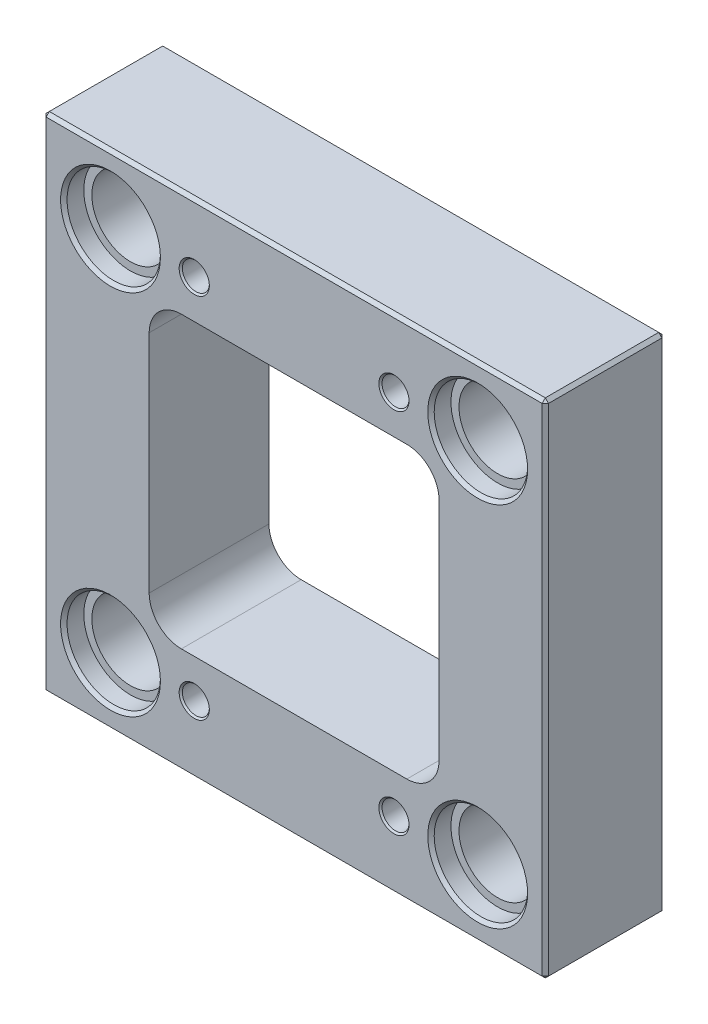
ISO-10303-21;
HEADER;
FILE_DESCRIPTION(('STEP AP214'),'2;1');
FILE_NAME('part.step','',(''),(''),'','','');
FILE_SCHEMA(('AUTOMOTIVE_DESIGN { 1 0 10303 214 1 1 1 1 }'));
ENDSEC;
DATA;
#1=APPLICATION_CONTEXT('core data for automotive mechanical design processes');
#2=APPLICATION_PROTOCOL_DEFINITION('international standard','automotive_design',2000,#1);
#3=PRODUCT_CONTEXT('',#1,'mechanical');
#4=PRODUCT('Part','Part','',(#3));
#5=PRODUCT_RELATED_PRODUCT_CATEGORY('part','',(#4));
#6=PRODUCT_DEFINITION_FORMATION('','',#4);
#7=PRODUCT_DEFINITION_CONTEXT('part definition',#1,'design');
#8=PRODUCT_DEFINITION('design','',#6,#7);
#9=PRODUCT_DEFINITION_SHAPE('','',#8);
#10=(LENGTH_UNIT() NAMED_UNIT(*) SI_UNIT(.MILLI.,.METRE.));
#11=(NAMED_UNIT(*) PLANE_ANGLE_UNIT() SI_UNIT($,.RADIAN.));
#12=(NAMED_UNIT(*) SI_UNIT($,.STERADIAN.) SOLID_ANGLE_UNIT());
#13=UNCERTAINTY_MEASURE_WITH_UNIT(LENGTH_MEASURE(1.E-05),#10,'distance_accuracy_value','');
#14=(GEOMETRIC_REPRESENTATION_CONTEXT(3) GLOBAL_UNCERTAINTY_ASSIGNED_CONTEXT((#13)) GLOBAL_UNIT_ASSIGNED_CONTEXT((#10,
#11,#12)) REPRESENTATION_CONTEXT('',''));
#15=CARTESIAN_POINT('',(0.,0.,0.));
#16=DIRECTION('',(0.,0.,1.));
#17=DIRECTION('',(1.,0.,0.));
#18=AXIS2_PLACEMENT_3D('',#15,#16,#17);
#19=CARTESIAN_POINT('',(109.,135.,17.2000000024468));
#20=DIRECTION('',(0.,0.,1.));
#21=DIRECTION('',(1.,0.,0.));
#22=AXIS2_PLACEMENT_3D('',#19,#20,#21);
#23=CONICAL_SURFACE('',#22,4.18799999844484,1.02974425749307);
#24=CARTESIAN_POINT('',(108.999999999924,135.,14.6835957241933));
#25=VERTEX_POINT('',#24);
#26=VERTEX_LOOP('',#25);
#27=FACE_BOUND('',#26,.T.);
#28=CARTESIAN_POINT('',(109.,135.,17.2));
#29=DIRECTION('',(0.,0.,1.));
#30=DIRECTION('',(1.,0.,0.));
#31=AXIS2_PLACEMENT_3D('',#28,#29,#30);
#32=CIRCLE('',#31,4.188);
#33=CARTESIAN_POINT('',(113.188,135.,17.2));
#34=VERTEX_POINT('',#33);
#35=EDGE_CURVE('E177',#34,#34,#32,.T.);
#36=ORIENTED_EDGE('',*,*,#35,.T.);
#37=EDGE_LOOP('',(#36));
#38=FACE_BOUND('',#37,.T.);
#39=ADVANCED_FACE('F17',(#27,#38),#23,.F.);
#40=CARTESIAN_POINT('',(109.,21.,17.2000000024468));
#41=DIRECTION('',(0.,0.,1.));
#42=DIRECTION('',(1.,0.,0.));
#43=AXIS2_PLACEMENT_3D('',#40,#41,#42);
#44=CONICAL_SURFACE('',#43,4.18799999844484,1.02974425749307);
#45=CARTESIAN_POINT('',(108.999999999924,21.,14.6835957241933));
#46=VERTEX_POINT('',#45);
#47=VERTEX_LOOP('',#46);
#48=FACE_BOUND('',#47,.T.);
#49=CARTESIAN_POINT('',(109.,21.,17.2));
#50=DIRECTION('',(0.,0.,1.));
#51=DIRECTION('',(1.,0.,0.));
#52=AXIS2_PLACEMENT_3D('',#49,#50,#51);
#53=CIRCLE('',#52,4.188);
#54=CARTESIAN_POINT('',(113.188,21.,17.2));
#55=VERTEX_POINT('',#54);
#56=EDGE_CURVE('E179',#55,#55,#53,.T.);
#57=ORIENTED_EDGE('',*,*,#56,.T.);
#58=EDGE_LOOP('',(#57));
#59=FACE_BOUND('',#58,.T.);
#60=ADVANCED_FACE('F174',(#48,#59),#44,.F.);
#61=CARTESIAN_POINT('',(47.,135.,17.2000000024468));
#62=DIRECTION('',(0.,0.,1.));
#63=DIRECTION('',(1.,0.,0.));
#64=AXIS2_PLACEMENT_3D('',#61,#62,#63);
#65=CONICAL_SURFACE('',#64,4.18799999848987,1.02974425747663);
#66=CARTESIAN_POINT('',(46.9999999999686,135.,14.6835957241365));
#67=VERTEX_POINT('',#66);
#68=VERTEX_LOOP('',#67);
#69=FACE_BOUND('',#68,.T.);
#70=CARTESIAN_POINT('',(47.,135.,17.2));
#71=DIRECTION('',(0.,0.,1.));
#72=DIRECTION('',(1.,0.,0.));
#73=AXIS2_PLACEMENT_3D('',#70,#71,#72);
#74=CIRCLE('',#73,4.188);
#75=CARTESIAN_POINT('',(51.188,135.,17.2));
#76=VERTEX_POINT('',#75);
#77=EDGE_CURVE('E182',#76,#76,#74,.T.);
#78=ORIENTED_EDGE('',*,*,#77,.T.);
#79=EDGE_LOOP('',(#78));
#80=FACE_BOUND('',#79,.T.);
#81=ADVANCED_FACE('F364',(#69,#80),#65,.F.);
#82=CARTESIAN_POINT('',(47.,21.,17.2000000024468));
#83=DIRECTION('',(0.,0.,1.));
#84=DIRECTION('',(1.,0.,0.));
#85=AXIS2_PLACEMENT_3D('',#82,#83,#84);
#86=CONICAL_SURFACE('',#85,4.18799999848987,1.02974425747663);
#87=CARTESIAN_POINT('',(46.9999999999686,21.,14.6835957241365));
#88=VERTEX_POINT('',#87);
#89=VERTEX_LOOP('',#88);
#90=FACE_BOUND('',#89,.T.);
#91=CARTESIAN_POINT('',(47.,21.,17.2));
#92=DIRECTION('',(0.,0.,1.));
#93=DIRECTION('',(1.,0.,0.));
#94=AXIS2_PLACEMENT_3D('',#91,#92,#93);
#95=CIRCLE('',#94,4.188);
#96=CARTESIAN_POINT('',(51.188,21.,17.2));
#97=VERTEX_POINT('',#96);
#98=EDGE_CURVE('E354',#97,#97,#95,.T.);
#99=ORIENTED_EDGE('',*,*,#98,.T.);
#100=EDGE_LOOP('',(#99));
#101=FACE_BOUND('',#100,.T.);
#102=ADVANCED_FACE('F867',(#90,#101),#86,.F.);
#103=CARTESIAN_POINT('',(0.500000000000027,155.5,36.2));
#104=DIRECTION('',(-0.577350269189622,0.577350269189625,0.577350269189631));
#105=DIRECTION('',(0.,-0.707106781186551,0.707106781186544));
#106=AXIS2_PLACEMENT_3D('',#103,#104,#105);
#107=PLANE('',#106);
#108=DIRECTION('',(0.,-0.707106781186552,0.707106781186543));
#109=VECTOR('',#108,1.);
#110=CARTESIAN_POINT('',(1.00000000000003,155.5,36.7));
#111=LINE('',#110,#109);
#112=CARTESIAN_POINT('',(1.00000000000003,156.,36.2));
#113=VERTEX_POINT('',#112);
#114=CARTESIAN_POINT('',(1.00000000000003,155.,37.2));
#115=VERTEX_POINT('',#114);
#116=EDGE_CURVE('E336',#113,#115,#111,.T.);
#117=ORIENTED_EDGE('',*,*,#116,.F.);
#118=DIRECTION('',(-0.707106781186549,-0.707106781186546,0.));
#119=VECTOR('',#118,1.);
#120=CARTESIAN_POINT('',(0.500000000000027,155.5,36.2));
#121=LINE('',#120,#119);
#122=CARTESIAN_POINT('',(0.,155.,36.2));
#123=VERTEX_POINT('',#122);
#124=EDGE_CURVE('E340',#123,#113,#121,.F.);
#125=ORIENTED_EDGE('',*,*,#124,.F.);
#126=DIRECTION('',(0.707106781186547,0.,0.707106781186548));
#127=VECTOR('',#126,1.);
#128=CARTESIAN_POINT('',(0.500000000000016,155.,36.7));
#129=LINE('',#128,#127);
#130=EDGE_CURVE('E334',#115,#123,#129,.F.);
#131=ORIENTED_EDGE('',*,*,#130,.F.);
#132=EDGE_LOOP('',(#117,#125,#131));
#133=FACE_BOUND('',#132,.T.);
#134=ADVANCED_FACE('F859',(#133),#107,.T.);
#135=CARTESIAN_POINT('',(0.499999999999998,0.5,36.2));
#136=DIRECTION('',(-0.577350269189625,-0.577350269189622,0.57735026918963));
#137=DIRECTION('',(0.707106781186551,0.,0.707106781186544));
#138=AXIS2_PLACEMENT_3D('',#135,#136,#137);
#139=PLANE('',#138);
#140=DIRECTION('',(0.707106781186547,0.,0.707106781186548));
#141=VECTOR('',#140,1.);
#142=CARTESIAN_POINT('',(0.500000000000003,1.,36.7));
#143=LINE('',#142,#141);
#144=CARTESIAN_POINT('',(0.,1.,36.2));
#145=VERTEX_POINT('',#144);
#146=CARTESIAN_POINT('',(1.00000000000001,1.,37.2));
#147=VERTEX_POINT('',#146);
#148=EDGE_CURVE('E332',#145,#147,#143,.T.);
#149=ORIENTED_EDGE('',*,*,#148,.F.);
#150=DIRECTION('',(0.707106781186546,-0.707106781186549,0.));
#151=VECTOR('',#150,1.);
#152=CARTESIAN_POINT('',(0.499999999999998,0.5,36.2));
#153=LINE('',#152,#151);
#154=CARTESIAN_POINT('',(0.999999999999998,0.,36.2));
#155=VERTEX_POINT('',#154);
#156=EDGE_CURVE('E352',#155,#145,#153,.F.);
#157=ORIENTED_EDGE('',*,*,#156,.F.);
#158=DIRECTION('',(0.,-0.707106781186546,-0.707106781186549));
#159=VECTOR('',#158,1.);
#160=CARTESIAN_POINT('',(1.,0.499999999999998,36.7));
#161=LINE('',#160,#159);
#162=EDGE_CURVE('E330',#147,#155,#161,.T.);
#163=ORIENTED_EDGE('',*,*,#162,.F.);
#164=EDGE_LOOP('',(#149,#157,#163));
#165=FACE_BOUND('',#164,.T.);
#166=ADVANCED_FACE('F851',(#165),#139,.T.);
#167=CARTESIAN_POINT('',(155.5,0.499999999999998,36.2));
#168=DIRECTION('',(0.577350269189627,-0.577350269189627,0.577350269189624));
#169=DIRECTION('',(0.707106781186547,0.707106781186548,0.));
#170=AXIS2_PLACEMENT_3D('',#167,#168,#169);
#171=PLANE('',#170);
#172=DIRECTION('',(0.707106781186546,0.,-0.707106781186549));
#173=VECTOR('',#172,1.);
#174=CARTESIAN_POINT('',(155.5,1.,36.7));
#175=LINE('',#174,#173);
#176=CARTESIAN_POINT('',(155.,1.,37.2));
#177=VERTEX_POINT('',#176);
#178=CARTESIAN_POINT('',(156.,0.999999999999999,36.2));
#179=VERTEX_POINT('',#178);
#180=EDGE_CURVE('E326',#177,#179,#175,.T.);
#181=ORIENTED_EDGE('',*,*,#180,.F.);
#182=DIRECTION('',(0.,-0.707106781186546,-0.707106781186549));
#183=VECTOR('',#182,1.);
#184=CARTESIAN_POINT('',(155.,0.499999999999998,36.7));
#185=LINE('',#184,#183);
#186=CARTESIAN_POINT('',(155.,0.,36.2));
#187=VERTEX_POINT('',#186);
#188=EDGE_CURVE('E328',#187,#177,#185,.F.);
#189=ORIENTED_EDGE('',*,*,#188,.F.);
#190=DIRECTION('',(0.707106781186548,0.707106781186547,0.));
#191=VECTOR('',#190,1.);
#192=CARTESIAN_POINT('',(155.5,0.499999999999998,36.2));
#193=LINE('',#192,#191);
#194=EDGE_CURVE('E348',#179,#187,#193,.F.);
#195=ORIENTED_EDGE('',*,*,#194,.F.);
#196=EDGE_LOOP('',(#181,#189,#195));
#197=FACE_BOUND('',#196,.T.);
#198=ADVANCED_FACE('F843',(#197),#171,.T.);
#199=CARTESIAN_POINT('',(155.5,155.5,36.2));
#200=DIRECTION('',(0.577350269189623,0.577350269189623,0.577350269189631));
#201=DIRECTION('',(0.,-0.707106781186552,0.707106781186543));
#202=AXIS2_PLACEMENT_3D('',#199,#200,#201);
#203=PLANE('',#202);
#204=DIRECTION('',(0.,-0.707106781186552,0.707106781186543));
#205=VECTOR('',#204,1.);
#206=CARTESIAN_POINT('',(155.,155.5,36.7));
#207=LINE('',#206,#205);
#208=CARTESIAN_POINT('',(155.,155.,37.2));
#209=VERTEX_POINT('',#208);
#210=CARTESIAN_POINT('',(155.,156.,36.2));
#211=VERTEX_POINT('',#210);
#212=EDGE_CURVE('E338',#209,#211,#207,.F.);
#213=ORIENTED_EDGE('',*,*,#212,.F.);
#214=DIRECTION('',(0.707106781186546,0.,-0.707106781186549));
#215=VECTOR('',#214,1.);
#216=CARTESIAN_POINT('',(155.5,155.,36.7));
#217=LINE('',#216,#215);
#218=CARTESIAN_POINT('',(156.,155.,36.2));
#219=VERTEX_POINT('',#218);
#220=EDGE_CURVE('E322',#219,#209,#217,.F.);
#221=ORIENTED_EDGE('',*,*,#220,.F.);
#222=DIRECTION('',(-0.707106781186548,0.707106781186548,0.));
#223=VECTOR('',#222,1.);
#224=CARTESIAN_POINT('',(155.5,155.5,36.2));
#225=LINE('',#224,#223);
#226=EDGE_CURVE('E344',#211,#219,#225,.F.);
#227=ORIENTED_EDGE('',*,*,#226,.F.);
#228=EDGE_LOOP('',(#213,#221,#227));
#229=FACE_BOUND('',#228,.T.);
#230=ADVANCED_FACE('F835',(#229),#203,.T.);
#231=CARTESIAN_POINT('',(109.,135.,27.2));
#232=DIRECTION('',(0.,0.,1.));
#233=DIRECTION('',(1.,0.,0.));
#234=AXIS2_PLACEMENT_3D('',#231,#232,#233);
#235=CYLINDRICAL_SURFACE('',#234,4.188);
#236=CARTESIAN_POINT('',(109.,135.,36.6999999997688));
#237=DIRECTION('',(0.,0.,1.));
#238=DIRECTION('',(-1.,0.,0.));
#239=AXIS2_PLACEMENT_3D('',#236,#237,#238);
#240=CIRCLE('',#239,4.18800000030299);
#241=CARTESIAN_POINT('',(104.811999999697,135.,36.6999999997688));
#242=VERTEX_POINT('',#241);
#243=EDGE_CURVE('E317',#242,#242,#240,.T.);
#244=ORIENTED_EDGE('',*,*,#243,.T.);
#245=EDGE_LOOP('',(#244));
#246=FACE_BOUND('',#245,.T.);
#247=ORIENTED_EDGE('',*,*,#35,.F.);
#248=EDGE_LOOP('',(#247));
#249=FACE_BOUND('',#248,.T.);
#250=ADVANCED_FACE('F379',(#246,#249),#235,.F.);
#251=CARTESIAN_POINT('',(109.,21.,27.2));
#252=DIRECTION('',(0.,0.,1.));
#253=DIRECTION('',(1.,0.,0.));
#254=AXIS2_PLACEMENT_3D('',#251,#252,#253);
#255=CYLINDRICAL_SURFACE('',#254,4.188);
#256=CARTESIAN_POINT('',(109.,21.,36.6999999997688));
#257=DIRECTION('',(0.,0.,1.));
#258=DIRECTION('',(-1.,0.,0.));
#259=AXIS2_PLACEMENT_3D('',#256,#257,#258);
#260=CIRCLE('',#259,4.18800000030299);
#261=CARTESIAN_POINT('',(104.811999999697,21.,36.6999999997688));
#262=VERTEX_POINT('',#261);
#263=EDGE_CURVE('E312',#262,#262,#260,.T.);
#264=ORIENTED_EDGE('',*,*,#263,.T.);
#265=EDGE_LOOP('',(#264));
#266=FACE_BOUND('',#265,.T.);
#267=ORIENTED_EDGE('',*,*,#56,.F.);
#268=EDGE_LOOP('',(#267));
#269=FACE_BOUND('',#268,.T.);
#270=ADVANCED_FACE('F369',(#266,#269),#255,.F.);
#271=CARTESIAN_POINT('',(47.,135.,27.2));
#272=DIRECTION('',(0.,0.,1.));
#273=DIRECTION('',(1.,0.,0.));
#274=AXIS2_PLACEMENT_3D('',#271,#272,#273);
#275=CYLINDRICAL_SURFACE('',#274,4.188);
#276=CARTESIAN_POINT('',(47.,135.,36.6999999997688));
#277=DIRECTION('',(0.,0.,1.));
#278=DIRECTION('',(-1.,0.,0.));
#279=AXIS2_PLACEMENT_3D('',#276,#277,#278);
#280=CIRCLE('',#279,4.1880000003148);
#281=CARTESIAN_POINT('',(42.8119999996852,135.,36.6999999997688));
#282=VERTEX_POINT('',#281);
#283=EDGE_CURVE('E281',#282,#282,#280,.T.);
#284=ORIENTED_EDGE('',*,*,#283,.T.);
#285=EDGE_LOOP('',(#284));
#286=FACE_BOUND('',#285,.T.);
#287=ORIENTED_EDGE('',*,*,#77,.F.);
#288=EDGE_LOOP('',(#287));
#289=FACE_BOUND('',#288,.T.);
#290=ADVANCED_FACE('F366',(#286,#289),#275,.F.);
#291=CARTESIAN_POINT('',(47.,21.,27.2));
#292=DIRECTION('',(0.,0.,1.));
#293=DIRECTION('',(1.,0.,0.));
#294=AXIS2_PLACEMENT_3D('',#291,#292,#293);
#295=CYLINDRICAL_SURFACE('',#294,4.188);
#296=CARTESIAN_POINT('',(47.,21.,36.6999999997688));
#297=DIRECTION('',(0.,0.,1.));
#298=DIRECTION('',(-1.,0.,0.));
#299=AXIS2_PLACEMENT_3D('',#296,#297,#298);
#300=CIRCLE('',#299,4.1880000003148);
#301=CARTESIAN_POINT('',(42.8119999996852,21.,36.6999999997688));
#302=VERTEX_POINT('',#301);
#303=EDGE_CURVE('E277',#302,#302,#300,.T.);
#304=ORIENTED_EDGE('',*,*,#303,.T.);
#305=EDGE_LOOP('',(#304));
#306=FACE_BOUND('',#305,.T.);
#307=ORIENTED_EDGE('',*,*,#98,.F.);
#308=EDGE_LOOP('',(#307));
#309=FACE_BOUND('',#308,.T.);
#310=ADVANCED_FACE('F368',(#306,#309),#295,.F.);
#311=CARTESIAN_POINT('',(135.,135.,34.1));
#312=DIRECTION('',(0.,0.,1.));
#313=DIRECTION('',(1.,0.,0.));
#314=AXIS2_PLACEMENT_3D('',#311,#312,#313);
#315=CYLINDRICAL_SURFACE('',#314,14.5);
#316=CARTESIAN_POINT('',(135.,135.,36.1999999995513));
#317=DIRECTION('',(0.,0.,1.));
#318=DIRECTION('',(-1.,0.,0.));
#319=AXIS2_PLACEMENT_3D('',#316,#317,#318);
#320=CIRCLE('',#319,14.5000000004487);
#321=CARTESIAN_POINT('',(120.499999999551,135.,36.1999999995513));
#322=VERTEX_POINT('',#321);
#323=EDGE_CURVE('E307',#322,#322,#320,.T.);
#324=ORIENTED_EDGE('',*,*,#323,.T.);
#325=EDGE_LOOP('',(#324));
#326=FACE_BOUND('',#325,.T.);
#327=CARTESIAN_POINT('',(135.,135.,31.));
#328=DIRECTION('',(0.,0.,1.));
#329=DIRECTION('',(1.,0.,0.));
#330=AXIS2_PLACEMENT_3D('',#327,#328,#329);
#331=CIRCLE('',#330,14.5);
#332=CARTESIAN_POINT('',(149.5,135.,31.));
#333=VERTEX_POINT('',#332);
#334=EDGE_CURVE('E20',#333,#333,#331,.T.);
#335=ORIENTED_EDGE('',*,*,#334,.F.);
#336=EDGE_LOOP('',(#335));
#337=FACE_BOUND('',#336,.T.);
#338=ADVANCED_FACE('F377',(#326,#337),#315,.F.);
#339=CARTESIAN_POINT('',(21.,21.,34.1));
#340=DIRECTION('',(0.,0.,1.));
#341=DIRECTION('',(1.,0.,0.));
#342=AXIS2_PLACEMENT_3D('',#339,#340,#341);
#343=CYLINDRICAL_SURFACE('',#342,14.5);
#344=CARTESIAN_POINT('',(21.,21.,36.1999999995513));
#345=DIRECTION('',(0.,0.,1.));
#346=DIRECTION('',(-1.,0.,0.));
#347=AXIS2_PLACEMENT_3D('',#344,#345,#346);
#348=CIRCLE('',#347,14.5000000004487);
#349=CARTESIAN_POINT('',(6.49999999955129,21.,36.1999999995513));
#350=VERTEX_POINT('',#349);
#351=EDGE_CURVE('E302',#350,#350,#348,.T.);
#352=ORIENTED_EDGE('',*,*,#351,.T.);
#353=EDGE_LOOP('',(#352));
#354=FACE_BOUND('',#353,.T.);
#355=CARTESIAN_POINT('',(21.,21.,31.));
#356=DIRECTION('',(0.,0.,1.));
#357=DIRECTION('',(1.,0.,0.));
#358=AXIS2_PLACEMENT_3D('',#355,#356,#357);
#359=CIRCLE('',#358,14.5);
#360=CARTESIAN_POINT('',(35.5,21.,31.));
#361=VERTEX_POINT('',#360);
#362=EDGE_CURVE('E272',#361,#361,#359,.T.);
#363=ORIENTED_EDGE('',*,*,#362,.F.);
#364=EDGE_LOOP('',(#363));
#365=FACE_BOUND('',#364,.T.);
#366=ADVANCED_FACE('F591',(#354,#365),#343,.F.);
#367=CARTESIAN_POINT('',(135.,21.,34.1));
#368=DIRECTION('',(0.,0.,1.));
#369=DIRECTION('',(1.,0.,0.));
#370=AXIS2_PLACEMENT_3D('',#367,#368,#369);
#371=CYLINDRICAL_SURFACE('',#370,14.5);
#372=CARTESIAN_POINT('',(135.,21.,36.1999999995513));
#373=DIRECTION('',(0.,0.,1.));
#374=DIRECTION('',(-1.,0.,0.));
#375=AXIS2_PLACEMENT_3D('',#372,#373,#374);
#376=CIRCLE('',#375,14.5000000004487);
#377=CARTESIAN_POINT('',(120.499999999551,21.,36.1999999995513));
#378=VERTEX_POINT('',#377);
#379=EDGE_CURVE('E297',#378,#378,#376,.T.);
#380=ORIENTED_EDGE('',*,*,#379,.T.);
#381=EDGE_LOOP('',(#380));
#382=FACE_BOUND('',#381,.T.);
#383=CARTESIAN_POINT('',(135.,21.,31.));
#384=DIRECTION('',(0.,0.,1.));
#385=DIRECTION('',(1.,0.,0.));
#386=AXIS2_PLACEMENT_3D('',#383,#384,#385);
#387=CIRCLE('',#386,14.5);
#388=CARTESIAN_POINT('',(149.5,21.,31.));
#389=VERTEX_POINT('',#388);
#390=EDGE_CURVE('E270',#389,#389,#387,.T.);
#391=ORIENTED_EDGE('',*,*,#390,.F.);
#392=EDGE_LOOP('',(#391));
#393=FACE_BOUND('',#392,.T.);
#394=ADVANCED_FACE('F587',(#382,#393),#371,.F.);
#395=CARTESIAN_POINT('',(21.,135.,34.1));
#396=DIRECTION('',(0.,0.,1.));
#397=DIRECTION('',(1.,0.,0.));
#398=AXIS2_PLACEMENT_3D('',#395,#396,#397);
#399=CYLINDRICAL_SURFACE('',#398,14.5);
#400=CARTESIAN_POINT('',(21.,135.,36.1999999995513));
#401=DIRECTION('',(0.,0.,1.));
#402=DIRECTION('',(-1.,0.,0.));
#403=AXIS2_PLACEMENT_3D('',#400,#401,#402);
#404=CIRCLE('',#403,14.5000000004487);
#405=CARTESIAN_POINT('',(6.49999999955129,135.,36.1999999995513));
#406=VERTEX_POINT('',#405);
#407=EDGE_CURVE('E286',#406,#406,#404,.T.);
#408=ORIENTED_EDGE('',*,*,#407,.T.);
#409=EDGE_LOOP('',(#408));
#410=FACE_BOUND('',#409,.T.);
#411=CARTESIAN_POINT('',(21.,135.,31.));
#412=DIRECTION('',(0.,0.,1.));
#413=DIRECTION('',(1.,0.,0.));
#414=AXIS2_PLACEMENT_3D('',#411,#412,#413);
#415=CIRCLE('',#414,14.5);
#416=CARTESIAN_POINT('',(35.5,135.,31.));
#417=VERTEX_POINT('',#416);
#418=EDGE_CURVE('E266',#417,#417,#415,.T.);
#419=ORIENTED_EDGE('',*,*,#418,.F.);
#420=EDGE_LOOP('',(#419));
#421=FACE_BOUND('',#420,.T.);
#422=ADVANCED_FACE('F583',(#410,#421),#399,.F.);
#423=CARTESIAN_POINT('',(0.499999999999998,0.5,0.));
#424=DIRECTION('',(-0.707106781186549,-0.707106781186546,0.));
#425=DIRECTION('',(0.707106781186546,-0.707106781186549,0.));
#426=AXIS2_PLACEMENT_3D('',#423,#424,#425);
#427=PLANE('',#426);
#428=DIRECTION('',(0.707106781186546,-0.707106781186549,0.));
#429=VECTOR('',#428,1.);
#430=CARTESIAN_POINT('',(0.499999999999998,0.5,1.));
#431=LINE('',#430,#429);
#432=CARTESIAN_POINT('',(0.,1.,1.));
#433=VERTEX_POINT('',#432);
#434=CARTESIAN_POINT('',(0.999999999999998,0.,1.));
#435=VERTEX_POINT('',#434);
#436=EDGE_CURVE('E350',#433,#435,#431,.T.);
#437=ORIENTED_EDGE('',*,*,#436,.T.);
#438=DIRECTION('',(0.,0.,-1.));
#439=VECTOR('',#438,1.);
#440=CARTESIAN_POINT('',(1.,0.,0.));
#441=LINE('',#440,#439);
#442=EDGE_CURVE('E943',#155,#435,#441,.T.);
#443=ORIENTED_EDGE('',*,*,#442,.F.);
#444=ORIENTED_EDGE('',*,*,#156,.T.);
#445=DIRECTION('',(0.,0.,1.));
#446=VECTOR('',#445,1.);
#447=CARTESIAN_POINT('',(0.,1.,0.));
#448=LINE('',#447,#446);
#449=EDGE_CURVE('E947',#433,#145,#448,.T.);
#450=ORIENTED_EDGE('',*,*,#449,.F.);
#451=EDGE_LOOP('',(#437,#443,#444,#450));
#452=FACE_BOUND('',#451,.T.);
#453=ADVANCED_FACE('F579',(#452),#427,.T.);
#454=CARTESIAN_POINT('',(155.5,0.499999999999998,0.));
#455=DIRECTION('',(0.707106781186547,-0.707106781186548,0.));
#456=DIRECTION('',(0.707106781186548,0.707106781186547,0.));
#457=AXIS2_PLACEMENT_3D('',#454,#455,#456);
#458=PLANE('',#457);
#459=DIRECTION('',(0.707106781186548,0.707106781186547,0.));
#460=VECTOR('',#459,1.);
#461=CARTESIAN_POINT('',(155.5,0.499999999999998,1.));
#462=LINE('',#461,#460);
#463=CARTESIAN_POINT('',(155.,0.,0.999999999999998));
#464=VERTEX_POINT('',#463);
#465=CARTESIAN_POINT('',(156.,0.999999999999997,1.00000000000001));
#466=VERTEX_POINT('',#465);
#467=EDGE_CURVE('E346',#464,#466,#462,.T.);
#468=ORIENTED_EDGE('',*,*,#467,.T.);
#469=DIRECTION('',(0.,0.,-1.));
#470=VECTOR('',#469,1.);
#471=CARTESIAN_POINT('',(156.,1.,0.));
#472=LINE('',#471,#470);
#473=EDGE_CURVE('E926',#179,#466,#472,.T.);
#474=ORIENTED_EDGE('',*,*,#473,.F.);
#475=ORIENTED_EDGE('',*,*,#194,.T.);
#476=DIRECTION('',(0.,0.,-1.));
#477=VECTOR('',#476,1.);
#478=CARTESIAN_POINT('',(155.,0.,0.));
#479=LINE('',#478,#477);
#480=EDGE_CURVE('E940',#464,#187,#479,.F.);
#481=ORIENTED_EDGE('',*,*,#480,.F.);
#482=EDGE_LOOP('',(#468,#474,#475,#481));
#483=FACE_BOUND('',#482,.T.);
#484=ADVANCED_FACE('F575',(#483),#458,.T.);
#485=CARTESIAN_POINT('',(155.5,155.5,0.));
#486=DIRECTION('',(0.707106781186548,0.707106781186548,0.));
#487=DIRECTION('',(-0.707106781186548,0.707106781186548,0.));
#488=AXIS2_PLACEMENT_3D('',#485,#486,#487);
#489=PLANE('',#488);
#490=DIRECTION('',(-0.707106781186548,0.707106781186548,0.));
#491=VECTOR('',#490,1.);
#492=CARTESIAN_POINT('',(155.5,155.5,1.));
#493=LINE('',#492,#491);
#494=CARTESIAN_POINT('',(156.,155.,0.999999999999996));
#495=VERTEX_POINT('',#494);
#496=CARTESIAN_POINT('',(155.,156.,0.999999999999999));
#497=VERTEX_POINT('',#496);
#498=EDGE_CURVE('E342',#495,#497,#493,.T.);
#499=ORIENTED_EDGE('',*,*,#498,.T.);
#500=DIRECTION('',(0.,0.,1.));
#501=VECTOR('',#500,1.);
#502=CARTESIAN_POINT('',(155.,156.,0.));
#503=LINE('',#502,#501);
#504=EDGE_CURVE('E920',#211,#497,#503,.F.);
#505=ORIENTED_EDGE('',*,*,#504,.F.);
#506=ORIENTED_EDGE('',*,*,#226,.T.);
#507=DIRECTION('',(0.,0.,-1.));
#508=VECTOR('',#507,1.);
#509=CARTESIAN_POINT('',(156.,155.,0.));
#510=LINE('',#509,#508);
#511=EDGE_CURVE('E934',#495,#219,#510,.F.);
#512=ORIENTED_EDGE('',*,*,#511,.F.);
#513=EDGE_LOOP('',(#499,#505,#506,#512));
#514=FACE_BOUND('',#513,.T.);
#515=ADVANCED_FACE('F571',(#514),#489,.T.);
#516=CARTESIAN_POINT('',(0.500000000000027,155.5,0.));
#517=DIRECTION('',(-0.707106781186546,0.707106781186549,0.));
#518=DIRECTION('',(-0.707106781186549,-0.707106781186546,0.));
#519=AXIS2_PLACEMENT_3D('',#516,#517,#518);
#520=PLANE('',#519);
#521=DIRECTION('',(-0.707106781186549,-0.707106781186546,0.));
#522=VECTOR('',#521,1.);
#523=CARTESIAN_POINT('',(0.750000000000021,155.75,1.00000000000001));
#524=LINE('',#523,#522);
#525=CARTESIAN_POINT('',(0.,155.,1.));
#526=VERTEX_POINT('',#525);
#527=CARTESIAN_POINT('',(1.00000000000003,156.,1.));
#528=VERTEX_POINT('',#527);
#529=EDGE_CURVE('E923',#526,#528,#524,.F.);
#530=ORIENTED_EDGE('',*,*,#529,.F.);
#531=DIRECTION('',(0.,0.,1.));
#532=VECTOR('',#531,1.);
#533=CARTESIAN_POINT('',(0.,155.,0.));
#534=LINE('',#533,#532);
#535=EDGE_CURVE('E269',#123,#526,#534,.F.);
#536=ORIENTED_EDGE('',*,*,#535,.F.);
#537=ORIENTED_EDGE('',*,*,#124,.T.);
#538=DIRECTION('',(0.,0.,1.));
#539=VECTOR('',#538,1.);
#540=CARTESIAN_POINT('',(1.00000000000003,156.,0.));
#541=LINE('',#540,#539);
#542=EDGE_CURVE('E912',#528,#113,#541,.T.);
#543=ORIENTED_EDGE('',*,*,#542,.F.);
#544=EDGE_LOOP('',(#530,#536,#537,#543));
#545=FACE_BOUND('',#544,.T.);
#546=ADVANCED_FACE('F567',(#545),#520,.T.);
#547=CARTESIAN_POINT('',(39.,155.5,36.7));
#548=DIRECTION('',(0.,0.707106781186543,0.707106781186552));
#549=DIRECTION('',(0.,-0.707106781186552,0.707106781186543));
#550=AXIS2_PLACEMENT_3D('',#547,#548,#549);
#551=PLANE('',#550);
#552=ORIENTED_EDGE('',*,*,#116,.T.);
#553=DIRECTION('',(1.,0.,0.));
#554=VECTOR('',#553,1.);
#555=CARTESIAN_POINT('',(78.,155.,37.2));
#556=LINE('',#555,#554);
#557=EDGE_CURVE('E919',#209,#115,#556,.F.);
#558=ORIENTED_EDGE('',*,*,#557,.F.);
#559=ORIENTED_EDGE('',*,*,#212,.T.);
#560=DIRECTION('',(1.,0.,0.));
#561=VECTOR('',#560,1.);
#562=CARTESIAN_POINT('',(0.,156.,36.2));
#563=LINE('',#562,#561);
#564=EDGE_CURVE('E914',#113,#211,#563,.T.);
#565=ORIENTED_EDGE('',*,*,#564,.F.);
#566=EDGE_LOOP('',(#552,#558,#559,#565));
#567=FACE_BOUND('',#566,.T.);
#568=ADVANCED_FACE('F563',(#567),#551,.T.);
#569=CARTESIAN_POINT('',(0.500000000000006,39.,36.7));
#570=DIRECTION('',(-0.707106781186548,0.,0.707106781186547));
#571=DIRECTION('',(0.707106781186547,0.,0.707106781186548));
#572=AXIS2_PLACEMENT_3D('',#569,#570,#571);
#573=PLANE('',#572);
#574=ORIENTED_EDGE('',*,*,#148,.T.);
#575=DIRECTION('',(0.,1.,0.));
#576=VECTOR('',#575,1.);
#577=CARTESIAN_POINT('',(1.00000000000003,78.,37.2));
#578=LINE('',#577,#576);
#579=EDGE_CURVE('E979',#115,#147,#578,.F.);
#580=ORIENTED_EDGE('',*,*,#579,.F.);
#581=ORIENTED_EDGE('',*,*,#130,.T.);
#582=DIRECTION('',(0.,1.,0.));
#583=VECTOR('',#582,1.);
#584=CARTESIAN_POINT('',(0.,0.,36.2));
#585=LINE('',#584,#583);
#586=EDGE_CURVE('E946',#145,#123,#585,.T.);
#587=ORIENTED_EDGE('',*,*,#586,.F.);
#588=EDGE_LOOP('',(#574,#580,#581,#587));
#589=FACE_BOUND('',#588,.T.);
#590=ADVANCED_FACE('F559',(#589),#573,.T.);
#591=CARTESIAN_POINT('',(117.,0.499999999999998,36.7));
#592=DIRECTION('',(0.,-0.707106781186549,0.707106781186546));
#593=DIRECTION('',(0.,-0.707106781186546,-0.707106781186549));
#594=AXIS2_PLACEMENT_3D('',#591,#592,#593);
#595=PLANE('',#594);
#596=ORIENTED_EDGE('',*,*,#188,.T.);
#597=DIRECTION('',(1.,0.,0.));
#598=VECTOR('',#597,1.);
#599=CARTESIAN_POINT('',(78.,1.,37.2));
#600=LINE('',#599,#598);
#601=EDGE_CURVE('E976',#147,#177,#600,.T.);
#602=ORIENTED_EDGE('',*,*,#601,.F.);
#603=ORIENTED_EDGE('',*,*,#162,.T.);
#604=DIRECTION('',(1.,0.,0.));
#605=VECTOR('',#604,1.);
#606=CARTESIAN_POINT('',(156.,0.,36.2));
#607=LINE('',#606,#605);
#608=EDGE_CURVE('E937',#187,#155,#607,.F.);
#609=ORIENTED_EDGE('',*,*,#608,.F.);
#610=EDGE_LOOP('',(#596,#602,#603,#609));
#611=FACE_BOUND('',#610,.T.);
#612=ADVANCED_FACE('F555',(#611),#595,.T.);
#613=CARTESIAN_POINT('',(155.5,117.,36.7));
#614=DIRECTION('',(0.707106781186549,0.,0.707106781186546));
#615=DIRECTION('',(0.707106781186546,0.,-0.707106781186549));
#616=AXIS2_PLACEMENT_3D('',#613,#614,#615);
#617=PLANE('',#616);
#618=ORIENTED_EDGE('',*,*,#220,.T.);
#619=DIRECTION('',(0.,1.,0.));
#620=VECTOR('',#619,1.);
#621=CARTESIAN_POINT('',(155.,78.,37.2));
#622=LINE('',#621,#620);
#623=EDGE_CURVE('E265',#177,#209,#622,.T.);
#624=ORIENTED_EDGE('',*,*,#623,.F.);
#625=ORIENTED_EDGE('',*,*,#180,.T.);
#626=DIRECTION('',(0.,1.,0.));
#627=VECTOR('',#626,1.);
#628=CARTESIAN_POINT('',(156.,156.,36.2));
#629=LINE('',#628,#627);
#630=EDGE_CURVE('E931',#219,#179,#629,.F.);
#631=ORIENTED_EDGE('',*,*,#630,.F.);
#632=EDGE_LOOP('',(#618,#624,#625,#631));
#633=FACE_BOUND('',#632,.T.);
#634=ADVANCED_FACE('F551',(#633),#617,.T.);
#635=CARTESIAN_POINT('',(109.,135.,37.2000000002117));
#636=DIRECTION('',(0.,0.,1.));
#637=DIRECTION('',(1.,0.,0.));
#638=AXIS2_PLACEMENT_3D('',#635,#636,#637);
#639=CONICAL_SURFACE('',#638,4.68799999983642,0.785398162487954);
#640=CARTESIAN_POINT('',(109.,135.,37.2000000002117));
#641=DIRECTION('',(0.,0.,1.));
#642=DIRECTION('',(1.,0.,0.));
#643=AXIS2_PLACEMENT_3D('',#640,#641,#642);
#644=CIRCLE('',#643,4.68799999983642);
#645=CARTESIAN_POINT('',(113.687999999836,135.,37.2000000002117));
#646=VERTEX_POINT('',#645);
#647=EDGE_CURVE('E262',#646,#646,#644,.F.);
#648=ORIENTED_EDGE('',*,*,#647,.F.);
#649=EDGE_LOOP('',(#648));
#650=FACE_BOUND('',#649,.T.);
#651=ORIENTED_EDGE('',*,*,#243,.F.);
#652=EDGE_LOOP('',(#651));
#653=FACE_BOUND('',#652,.T.);
#654=ADVANCED_FACE('F547',(#650,#653),#639,.F.);
#655=CARTESIAN_POINT('',(109.,21.,37.2000000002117));
#656=DIRECTION('',(0.,0.,1.));
#657=DIRECTION('',(1.,0.,0.));
#658=AXIS2_PLACEMENT_3D('',#655,#656,#657);
#659=CONICAL_SURFACE('',#658,4.68799999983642,0.785398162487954);
#660=CARTESIAN_POINT('',(109.,21.,37.2000000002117));
#661=DIRECTION('',(0.,0.,1.));
#662=DIRECTION('',(1.,0.,0.));
#663=AXIS2_PLACEMENT_3D('',#660,#661,#662);
#664=CIRCLE('',#663,4.68799999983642);
#665=CARTESIAN_POINT('',(113.687999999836,21.,37.2000000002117));
#666=VERTEX_POINT('',#665);
#667=EDGE_CURVE('E259',#666,#666,#664,.F.);
#668=ORIENTED_EDGE('',*,*,#667,.F.);
#669=EDGE_LOOP('',(#668));
#670=FACE_BOUND('',#669,.T.);
#671=ORIENTED_EDGE('',*,*,#263,.F.);
#672=EDGE_LOOP('',(#671));
#673=FACE_BOUND('',#672,.T.);
#674=ADVANCED_FACE('F543',(#670,#673),#659,.F.);
#675=CARTESIAN_POINT('',(135.,135.,37.2000000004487));
#676=DIRECTION('',(0.,0.,1.));
#677=DIRECTION('',(1.,0.,0.));
#678=AXIS2_PLACEMENT_3D('',#675,#676,#677);
#679=CONICAL_SURFACE('',#678,15.4999999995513,0.785398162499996);
#680=CARTESIAN_POINT('',(135.,135.,37.2000000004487));
#681=DIRECTION('',(0.,0.,1.));
#682=DIRECTION('',(1.,0.,0.));
#683=AXIS2_PLACEMENT_3D('',#680,#681,#682);
#684=CIRCLE('',#683,15.4999999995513);
#685=CARTESIAN_POINT('',(150.499999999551,135.,37.2000000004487));
#686=VERTEX_POINT('',#685);
#687=EDGE_CURVE('E256',#686,#686,#684,.F.);
#688=ORIENTED_EDGE('',*,*,#687,.F.);
#689=EDGE_LOOP('',(#688));
#690=FACE_BOUND('',#689,.T.);
#691=ORIENTED_EDGE('',*,*,#323,.F.);
#692=EDGE_LOOP('',(#691));
#693=FACE_BOUND('',#692,.T.);
#694=ADVANCED_FACE('F539',(#690,#693),#679,.F.);
#695=CARTESIAN_POINT('',(21.,21.,37.2000000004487));
#696=DIRECTION('',(0.,0.,1.));
#697=DIRECTION('',(1.,0.,0.));
#698=AXIS2_PLACEMENT_3D('',#695,#696,#697);
#699=CONICAL_SURFACE('',#698,15.4999999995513,0.7853981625);
#700=CARTESIAN_POINT('',(21.,21.,37.2000000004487));
#701=DIRECTION('',(0.,0.,1.));
#702=DIRECTION('',(1.,0.,0.));
#703=AXIS2_PLACEMENT_3D('',#700,#701,#702);
#704=CIRCLE('',#703,15.4999999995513);
#705=CARTESIAN_POINT('',(36.4999999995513,21.,37.2000000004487));
#706=VERTEX_POINT('',#705);
#707=EDGE_CURVE('E253',#706,#706,#704,.F.);
#708=ORIENTED_EDGE('',*,*,#707,.F.);
#709=EDGE_LOOP('',(#708));
#710=FACE_BOUND('',#709,.T.);
#711=ORIENTED_EDGE('',*,*,#351,.F.);
#712=EDGE_LOOP('',(#711));
#713=FACE_BOUND('',#712,.T.);
#714=ADVANCED_FACE('F535',(#710,#713),#699,.F.);
#715=CARTESIAN_POINT('',(135.,21.,37.2000000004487));
#716=DIRECTION('',(0.,0.,1.));
#717=DIRECTION('',(1.,0.,0.));
#718=AXIS2_PLACEMENT_3D('',#715,#716,#717);
#719=CONICAL_SURFACE('',#718,15.4999999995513,0.785398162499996);
#720=CARTESIAN_POINT('',(135.,21.,37.2000000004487));
#721=DIRECTION('',(0.,0.,1.));
#722=DIRECTION('',(1.,0.,0.));
#723=AXIS2_PLACEMENT_3D('',#720,#721,#722);
#724=CIRCLE('',#723,15.4999999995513);
#725=CARTESIAN_POINT('',(150.499999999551,21.,37.2000000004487));
#726=VERTEX_POINT('',#725);
#727=EDGE_CURVE('E250',#726,#726,#724,.F.);
#728=ORIENTED_EDGE('',*,*,#727,.F.);
#729=EDGE_LOOP('',(#728));
#730=FACE_BOUND('',#729,.T.);
#731=ORIENTED_EDGE('',*,*,#379,.F.);
#732=EDGE_LOOP('',(#731));
#733=FACE_BOUND('',#732,.T.);
#734=ADVANCED_FACE('F531',(#730,#733),#719,.F.);
#735=CARTESIAN_POINT('',(21.,135.,37.2000000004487));
#736=DIRECTION('',(0.,0.,1.));
#737=DIRECTION('',(1.,0.,0.));
#738=AXIS2_PLACEMENT_3D('',#735,#736,#737);
#739=CONICAL_SURFACE('',#738,15.4999999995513,0.7853981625);
#740=CARTESIAN_POINT('',(21.,135.,37.2000000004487));
#741=DIRECTION('',(0.,0.,1.));
#742=DIRECTION('',(1.,0.,0.));
#743=AXIS2_PLACEMENT_3D('',#740,#741,#742);
#744=CIRCLE('',#743,15.4999999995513);
#745=CARTESIAN_POINT('',(36.4999999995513,135.,37.2000000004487));
#746=VERTEX_POINT('',#745);
#747=EDGE_CURVE('E247',#746,#746,#744,.F.);
#748=ORIENTED_EDGE('',*,*,#747,.F.);
#749=EDGE_LOOP('',(#748));
#750=FACE_BOUND('',#749,.T.);
#751=ORIENTED_EDGE('',*,*,#407,.F.);
#752=EDGE_LOOP('',(#751));
#753=FACE_BOUND('',#752,.T.);
#754=ADVANCED_FACE('F527',(#750,#753),#739,.F.);
#755=CARTESIAN_POINT('',(47.,135.,37.200000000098));
#756=DIRECTION('',(0.,0.,1.));
#757=DIRECTION('',(1.,0.,0.));
#758=AXIS2_PLACEMENT_3D('',#755,#756,#757);
#759=CONICAL_SURFACE('',#758,4.6879999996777,0.78539816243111);
#760=CARTESIAN_POINT('',(47.,135.,37.2000000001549));
#761=DIRECTION('',(0.,0.,1.));
#762=DIRECTION('',(1.,0.,0.));
#763=AXIS2_PLACEMENT_3D('',#760,#761,#762);
#764=CIRCLE('',#763,4.68799999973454);
#765=CARTESIAN_POINT('',(51.6879999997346,135.,37.2000000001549));
#766=VERTEX_POINT('',#765);
#767=EDGE_CURVE('E244',#766,#766,#764,.F.);
#768=ORIENTED_EDGE('',*,*,#767,.F.);
#769=EDGE_LOOP('',(#768));
#770=FACE_BOUND('',#769,.T.);
#771=ORIENTED_EDGE('',*,*,#283,.F.);
#772=EDGE_LOOP('',(#771));
#773=FACE_BOUND('',#772,.T.);
#774=ADVANCED_FACE('F523',(#770,#773),#759,.F.);
#775=CARTESIAN_POINT('',(47.,21.,37.200000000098));
#776=DIRECTION('',(0.,0.,1.));
#777=DIRECTION('',(1.,0.,0.));
#778=AXIS2_PLACEMENT_3D('',#775,#776,#777);
#779=CONICAL_SURFACE('',#778,4.6879999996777,0.78539816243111);
#780=CARTESIAN_POINT('',(47.,21.,37.2000000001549));
#781=DIRECTION('',(0.,0.,1.));
#782=DIRECTION('',(1.,0.,0.));
#783=AXIS2_PLACEMENT_3D('',#780,#781,#782);
#784=CIRCLE('',#783,4.68799999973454);
#785=CARTESIAN_POINT('',(51.6879999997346,21.,37.2000000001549));
#786=VERTEX_POINT('',#785);
#787=EDGE_CURVE('E241',#786,#786,#784,.F.);
#788=ORIENTED_EDGE('',*,*,#787,.F.);
#789=EDGE_LOOP('',(#788));
#790=FACE_BOUND('',#789,.T.);
#791=ORIENTED_EDGE('',*,*,#303,.F.);
#792=EDGE_LOOP('',(#791));
#793=FACE_BOUND('',#792,.T.);
#794=ADVANCED_FACE('F519',(#790,#793),#779,.F.);
#795=CARTESIAN_POINT('',(135.,135.,31.));
#796=DIRECTION('',(0.,0.,1.));
#797=DIRECTION('',(1.,0.,0.));
#798=AXIS2_PLACEMENT_3D('',#795,#796,#797);
#799=PLANE('',#798);
#800=CARTESIAN_POINT('',(135.,135.,31.));
#801=DIRECTION('',(0.,0.,1.));
#802=DIRECTION('',(1.,0.,0.));
#803=AXIS2_PLACEMENT_3D('',#800,#801,#802);
#804=CIRCLE('',#803,12.00525);
#805=CARTESIAN_POINT('',(147.00525,135.,31.));
#806=VERTEX_POINT('',#805);
#807=EDGE_CURVE('E238',#806,#806,#804,.F.);
#808=ORIENTED_EDGE('',*,*,#807,.T.);
#809=EDGE_LOOP('',(#808));
#810=FACE_BOUND('',#809,.T.);
#811=ORIENTED_EDGE('',*,*,#334,.T.);
#812=EDGE_LOOP('',(#811));
#813=FACE_BOUND('',#812,.T.);
#814=ADVANCED_FACE('F515',(#810,#813),#799,.T.);
#815=CARTESIAN_POINT('',(21.,21.,31.));
#816=DIRECTION('',(0.,0.,1.));
#817=DIRECTION('',(1.,0.,0.));
#818=AXIS2_PLACEMENT_3D('',#815,#816,#817);
#819=PLANE('',#818);
#820=CARTESIAN_POINT('',(21.,21.,31.));
#821=DIRECTION('',(0.,0.,1.));
#822=DIRECTION('',(1.,0.,0.));
#823=AXIS2_PLACEMENT_3D('',#820,#821,#822);
#824=CIRCLE('',#823,12.00525);
#825=CARTESIAN_POINT('',(33.00525,21.,31.));
#826=VERTEX_POINT('',#825);
#827=EDGE_CURVE('E235',#826,#826,#824,.F.);
#828=ORIENTED_EDGE('',*,*,#827,.T.);
#829=EDGE_LOOP('',(#828));
#830=FACE_BOUND('',#829,.T.);
#831=ORIENTED_EDGE('',*,*,#362,.T.);
#832=EDGE_LOOP('',(#831));
#833=FACE_BOUND('',#832,.T.);
#834=ADVANCED_FACE('F511',(#830,#833),#819,.T.);
#835=CARTESIAN_POINT('',(135.,21.,31.));
#836=DIRECTION('',(0.,0.,1.));
#837=DIRECTION('',(1.,0.,0.));
#838=AXIS2_PLACEMENT_3D('',#835,#836,#837);
#839=PLANE('',#838);
#840=CARTESIAN_POINT('',(135.,21.,31.));
#841=DIRECTION('',(0.,0.,1.));
#842=DIRECTION('',(1.,0.,0.));
#843=AXIS2_PLACEMENT_3D('',#840,#841,#842);
#844=CIRCLE('',#843,12.00525);
#845=CARTESIAN_POINT('',(147.00525,21.,31.));
#846=VERTEX_POINT('',#845);
#847=EDGE_CURVE('E232',#846,#846,#844,.F.);
#848=ORIENTED_EDGE('',*,*,#847,.T.);
#849=EDGE_LOOP('',(#848));
#850=FACE_BOUND('',#849,.T.);
#851=ORIENTED_EDGE('',*,*,#390,.T.);
#852=EDGE_LOOP('',(#851));
#853=FACE_BOUND('',#852,.T.);
#854=ADVANCED_FACE('F507',(#850,#853),#839,.T.);
#855=CARTESIAN_POINT('',(21.,135.,31.));
#856=DIRECTION('',(0.,0.,1.));
#857=DIRECTION('',(1.,0.,0.));
#858=AXIS2_PLACEMENT_3D('',#855,#856,#857);
#859=PLANE('',#858);
#860=CARTESIAN_POINT('',(21.,135.,31.));
#861=DIRECTION('',(0.,0.,1.));
#862=DIRECTION('',(1.,0.,0.));
#863=AXIS2_PLACEMENT_3D('',#860,#861,#862);
#864=CIRCLE('',#863,12.00525);
#865=CARTESIAN_POINT('',(33.00525,135.,31.));
#866=VERTEX_POINT('',#865);
#867=EDGE_CURVE('E228',#866,#866,#864,.F.);
#868=ORIENTED_EDGE('',*,*,#867,.T.);
#869=EDGE_LOOP('',(#868));
#870=FACE_BOUND('',#869,.T.);
#871=ORIENTED_EDGE('',*,*,#418,.T.);
#872=EDGE_LOOP('',(#871));
#873=FACE_BOUND('',#872,.T.);
#874=ADVANCED_FACE('F503',(#870,#873),#859,.T.);
#875=CARTESIAN_POINT('',(0.,0.,0.));
#876=DIRECTION('',(-1.,0.,0.));
#877=DIRECTION('',(0.,0.,1.));
#878=AXIS2_PLACEMENT_3D('',#875,#876,#877);
#879=PLANE('',#878);
#880=ORIENTED_EDGE('',*,*,#449,.T.);
#881=ORIENTED_EDGE('',*,*,#586,.T.);
#882=ORIENTED_EDGE('',*,*,#535,.T.);
#883=DIRECTION('',(0.,1.,0.));
#884=VECTOR('',#883,1.);
#885=CARTESIAN_POINT('',(0.,39.,1.));
#886=LINE('',#885,#884);
#887=EDGE_CURVE('E953',#433,#526,#886,.T.);
#888=ORIENTED_EDGE('',*,*,#887,.F.);
#889=EDGE_LOOP('',(#880,#881,#882,#888));
#890=FACE_BOUND('',#889,.T.);
#891=ADVANCED_FACE('F499',(#890),#879,.T.);
#892=CARTESIAN_POINT('',(156.,0.,0.));
#893=DIRECTION('',(0.,-1.,0.));
#894=DIRECTION('',(0.,0.,-1.));
#895=AXIS2_PLACEMENT_3D('',#892,#893,#894);
#896=PLANE('',#895);
#897=ORIENTED_EDGE('',*,*,#480,.T.);
#898=ORIENTED_EDGE('',*,*,#608,.T.);
#899=ORIENTED_EDGE('',*,*,#442,.T.);
#900=DIRECTION('',(1.,0.,0.));
#901=VECTOR('',#900,1.);
#902=CARTESIAN_POINT('',(117.,0.,1.));
#903=LINE('',#902,#901);
#904=EDGE_CURVE('E965',#464,#435,#903,.F.);
#905=ORIENTED_EDGE('',*,*,#904,.F.);
#906=EDGE_LOOP('',(#897,#898,#899,#905));
#907=FACE_BOUND('',#906,.T.);
#908=ADVANCED_FACE('F495',(#907),#896,.T.);
#909=CARTESIAN_POINT('',(0.999999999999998,0.499999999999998,0.5));
#910=DIRECTION('',(-0.577350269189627,-0.577350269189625,-0.577350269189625));
#911=DIRECTION('',(-0.707106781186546,0.,0.707106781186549));
#912=AXIS2_PLACEMENT_3D('',#909,#910,#911);
#913=PLANE('',#912);
#914=ORIENTED_EDGE('',*,*,#436,.F.);
#915=DIRECTION('',(-0.707106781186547,0.,0.707106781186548));
#916=VECTOR('',#915,1.);
#917=CARTESIAN_POINT('',(0.500000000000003,0.999999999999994,0.499999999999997));
#918=LINE('',#917,#916);
#919=CARTESIAN_POINT('',(1.00000000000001,0.999999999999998,0.));
#920=VERTEX_POINT('',#919);
#921=EDGE_CURVE('E231',#920,#433,#918,.T.);
#922=ORIENTED_EDGE('',*,*,#921,.F.);
#923=DIRECTION('',(0.,0.707106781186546,-0.707106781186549));
#924=VECTOR('',#923,1.);
#925=CARTESIAN_POINT('',(1.,0.499999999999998,0.5));
#926=LINE('',#925,#924);
#927=EDGE_CURVE('E1009',#435,#920,#926,.T.);
#928=ORIENTED_EDGE('',*,*,#927,.F.);
#929=EDGE_LOOP('',(#914,#922,#928));
#930=FACE_BOUND('',#929,.T.);
#931=ADVANCED_FACE('F491',(#930),#913,.T.);
#932=CARTESIAN_POINT('',(156.,156.,0.));
#933=DIRECTION('',(1.,0.,0.));
#934=DIRECTION('',(0.,0.,-1.));
#935=AXIS2_PLACEMENT_3D('',#932,#933,#934);
#936=PLANE('',#935);
#937=ORIENTED_EDGE('',*,*,#473,.T.);
#938=DIRECTION('',(0.,1.,0.));
#939=VECTOR('',#938,1.);
#940=CARTESIAN_POINT('',(156.,117.,1.00000000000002));
#941=LINE('',#940,#939);
#942=EDGE_CURVE('E1003',#495,#466,#941,.F.);
#943=ORIENTED_EDGE('',*,*,#942,.F.);
#944=ORIENTED_EDGE('',*,*,#511,.T.);
#945=ORIENTED_EDGE('',*,*,#630,.T.);
#946=EDGE_LOOP('',(#937,#943,#944,#945));
#947=FACE_BOUND('',#946,.T.);
#948=ADVANCED_FACE('F487',(#947),#936,.T.);
#949=CARTESIAN_POINT('',(155.,0.499999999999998,0.5));
#950=DIRECTION('',(0.577350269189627,-0.577350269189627,-0.577350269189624));
#951=DIRECTION('',(0.707106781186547,0.707106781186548,0.));
#952=AXIS2_PLACEMENT_3D('',#949,#950,#951);
#953=PLANE('',#952);
#954=DIRECTION('',(-0.707106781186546,0.,-0.707106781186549));
#955=VECTOR('',#954,1.);
#956=CARTESIAN_POINT('',(155.5,1.,0.500000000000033));
#957=LINE('',#956,#955);
#958=CARTESIAN_POINT('',(155.,0.999999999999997,0.));
#959=VERTEX_POINT('',#958);
#960=EDGE_CURVE('E1000',#466,#959,#957,.T.);
#961=ORIENTED_EDGE('',*,*,#960,.F.);
#962=ORIENTED_EDGE('',*,*,#467,.F.);
#963=DIRECTION('',(0.,0.707106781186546,-0.707106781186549));
#964=VECTOR('',#963,1.);
#965=CARTESIAN_POINT('',(155.,0.499999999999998,0.5));
#966=LINE('',#965,#964);
#967=EDGE_CURVE('E962',#959,#464,#966,.F.);
#968=ORIENTED_EDGE('',*,*,#967,.F.);
#969=EDGE_LOOP('',(#961,#962,#968));
#970=FACE_BOUND('',#969,.T.);
#971=ADVANCED_FACE('F483',(#970),#953,.T.);
#972=CARTESIAN_POINT('',(1.00000000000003,155.5,0.5));
#973=DIRECTION('',(-0.577350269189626,0.577350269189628,-0.577350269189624));
#974=DIRECTION('',(-0.707106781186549,-0.707106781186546,0.));
#975=AXIS2_PLACEMENT_3D('',#972,#973,#974);
#976=PLANE('',#975);
#977=ORIENTED_EDGE('',*,*,#529,.T.);
#978=DIRECTION('',(0.,0.707106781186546,0.707106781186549));
#979=VECTOR('',#978,1.);
#980=CARTESIAN_POINT('',(1.00000000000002,155.5,0.499999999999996));
#981=LINE('',#980,#979);
#982=CARTESIAN_POINT('',(1.00000000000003,155.,0.));
#983=VERTEX_POINT('',#982);
#984=EDGE_CURVE('E960',#983,#528,#981,.T.);
#985=ORIENTED_EDGE('',*,*,#984,.F.);
#986=DIRECTION('',(-0.707106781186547,0.,0.707106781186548));
#987=VECTOR('',#986,1.);
#988=CARTESIAN_POINT('',(0.500000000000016,155.,0.50000000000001));
#989=LINE('',#988,#987);
#990=EDGE_CURVE('E93',#526,#983,#989,.F.);
#991=ORIENTED_EDGE('',*,*,#990,.F.);
#992=EDGE_LOOP('',(#977,#985,#991));
#993=FACE_BOUND('',#992,.T.);
#994=ADVANCED_FACE('F479',(#993),#976,.T.);
#995=CARTESIAN_POINT('',(0.,156.,0.));
#996=DIRECTION('',(0.,1.,0.));
#997=DIRECTION('',(0.,0.,1.));
#998=AXIS2_PLACEMENT_3D('',#995,#996,#997);
#999=PLANE('',#998);
#1000=DIRECTION('',(1.,0.,0.));
#1001=VECTOR('',#1000,1.);
#1002=CARTESIAN_POINT('',(39.,156.,1.));
#1003=LINE('',#1002,#1001);
#1004=EDGE_CURVE('E917',#528,#497,#1003,.T.);
#1005=ORIENTED_EDGE('',*,*,#1004,.F.);
#1006=ORIENTED_EDGE('',*,*,#542,.T.);
#1007=ORIENTED_EDGE('',*,*,#564,.T.);
#1008=ORIENTED_EDGE('',*,*,#504,.T.);
#1009=EDGE_LOOP('',(#1005,#1006,#1007,#1008));
#1010=FACE_BOUND('',#1009,.T.);
#1011=ADVANCED_FACE('F475',(#1010),#999,.T.);
#1012=CARTESIAN_POINT('',(155.5,155.,0.5));
#1013=DIRECTION('',(0.577350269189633,0.577350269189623,-0.577350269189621));
#1014=DIRECTION('',(-0.707106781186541,0.707106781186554,0.));
#1015=AXIS2_PLACEMENT_3D('',#1012,#1013,#1014);
#1016=PLANE('',#1015);
#1017=ORIENTED_EDGE('',*,*,#498,.F.);
#1018=DIRECTION('',(-0.707106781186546,0.,-0.707106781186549));
#1019=VECTOR('',#1018,1.);
#1020=CARTESIAN_POINT('',(155.5,155.,0.499999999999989));
#1021=LINE('',#1020,#1019);
#1022=CARTESIAN_POINT('',(155.,155.,0.));
#1023=VERTEX_POINT('',#1022);
#1024=EDGE_CURVE('E1006',#1023,#495,#1021,.F.);
#1025=ORIENTED_EDGE('',*,*,#1024,.F.);
#1026=DIRECTION('',(0.,0.707106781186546,0.707106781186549));
#1027=VECTOR('',#1026,1.);
#1028=CARTESIAN_POINT('',(155.,155.5,0.500000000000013));
#1029=LINE('',#1028,#1027);
#1030=EDGE_CURVE('E227',#497,#1023,#1029,.F.);
#1031=ORIENTED_EDGE('',*,*,#1030,.F.);
#1032=EDGE_LOOP('',(#1017,#1025,#1031));
#1033=FACE_BOUND('',#1032,.T.);
#1034=ADVANCED_FACE('F471',(#1033),#1016,.T.);
#1035=CARTESIAN_POINT('',(78.,78.,37.2));
#1036=DIRECTION('',(0.,0.,1.));
#1037=DIRECTION('',(1.,0.,0.));
#1038=AXIS2_PLACEMENT_3D('',#1035,#1036,#1037);
#1039=PLANE('',#1038);
#1040=ORIENTED_EDGE('',*,*,#787,.T.);
#1041=EDGE_LOOP('',(#1040));
#1042=FACE_BOUND('',#1041,.T.);
#1043=ORIENTED_EDGE('',*,*,#767,.T.);
#1044=EDGE_LOOP('',(#1043));
#1045=FACE_BOUND('',#1044,.T.);
#1046=ORIENTED_EDGE('',*,*,#747,.T.);
#1047=EDGE_LOOP('',(#1046));
#1048=FACE_BOUND('',#1047,.T.);
#1049=ORIENTED_EDGE('',*,*,#727,.T.);
#1050=EDGE_LOOP('',(#1049));
#1051=FACE_BOUND('',#1050,.T.);
#1052=ORIENTED_EDGE('',*,*,#707,.T.);
#1053=EDGE_LOOP('',(#1052));
#1054=FACE_BOUND('',#1053,.T.);
#1055=ORIENTED_EDGE('',*,*,#687,.T.);
#1056=EDGE_LOOP('',(#1055));
#1057=FACE_BOUND('',#1056,.T.);
#1058=ORIENTED_EDGE('',*,*,#667,.T.);
#1059=EDGE_LOOP('',(#1058));
#1060=FACE_BOUND('',#1059,.T.);
#1061=ORIENTED_EDGE('',*,*,#647,.T.);
#1062=EDGE_LOOP('',(#1061));
#1063=FACE_BOUND('',#1062,.T.);
#1064=DIRECTION('',(1.,0.,0.));
#1065=VECTOR('',#1064,1.);
#1066=CARTESIAN_POINT('',(43.,33.,37.2));
#1067=LINE('',#1066,#1065);
#1068=CARTESIAN_POINT('',(113.,33.,37.2));
#1069=VERTEX_POINT('',#1068);
#1070=CARTESIAN_POINT('',(43.,33.,37.2));
#1071=VERTEX_POINT('',#1070);
#1072=EDGE_CURVE('E983',#1069,#1071,#1067,.F.);
#1073=ORIENTED_EDGE('',*,*,#1072,.T.);
#1074=CARTESIAN_POINT('',(43.,43.,37.2));
#1075=DIRECTION('',(0.,0.,-1.));
#1076=DIRECTION('',(-1.,0.,0.));
#1077=AXIS2_PLACEMENT_3D('',#1074,#1075,#1076);
#1078=CIRCLE('',#1077,10.);
#1079=CARTESIAN_POINT('',(33.,43.,37.2));
#1080=VERTEX_POINT('',#1079);
#1081=EDGE_CURVE('E214',#1071,#1080,#1078,.T.);
#1082=ORIENTED_EDGE('',*,*,#1081,.T.);
#1083=DIRECTION('',(0.,1.,0.));
#1084=VECTOR('',#1083,1.);
#1085=CARTESIAN_POINT('',(33.,113.,37.2));
#1086=LINE('',#1085,#1084);
#1087=CARTESIAN_POINT('',(33.,113.,37.2));
#1088=VERTEX_POINT('',#1087);
#1089=EDGE_CURVE('E970',#1080,#1088,#1086,.T.);
#1090=ORIENTED_EDGE('',*,*,#1089,.T.);
#1091=CARTESIAN_POINT('',(43.,113.,37.2));
#1092=DIRECTION('',(0.,0.,-1.));
#1093=DIRECTION('',(-1.,0.,0.));
#1094=AXIS2_PLACEMENT_3D('',#1091,#1092,#1093);
#1095=CIRCLE('',#1094,10.);
#1096=CARTESIAN_POINT('',(43.,123.,37.2));
#1097=VERTEX_POINT('',#1096);
#1098=EDGE_CURVE('E84',#1088,#1097,#1095,.T.);
#1099=ORIENTED_EDGE('',*,*,#1098,.T.);
#1100=DIRECTION('',(1.,0.,0.));
#1101=VECTOR('',#1100,1.);
#1102=CARTESIAN_POINT('',(113.,123.,37.2));
#1103=LINE('',#1102,#1101);
#1104=CARTESIAN_POINT('',(113.,123.,37.2));
#1105=VERTEX_POINT('',#1104);
#1106=EDGE_CURVE('E987',#1097,#1105,#1103,.T.);
#1107=ORIENTED_EDGE('',*,*,#1106,.T.);
#1108=CARTESIAN_POINT('',(113.,113.,37.2));
#1109=DIRECTION('',(0.,0.,-1.));
#1110=DIRECTION('',(-1.,0.,0.));
#1111=AXIS2_PLACEMENT_3D('',#1108,#1109,#1110);
#1112=CIRCLE('',#1111,10.);
#1113=CARTESIAN_POINT('',(123.,113.,37.2));
#1114=VERTEX_POINT('',#1113);
#1115=EDGE_CURVE('E221',#1105,#1114,#1112,.T.);
#1116=ORIENTED_EDGE('',*,*,#1115,.T.);
#1117=DIRECTION('',(0.,1.,0.));
#1118=VECTOR('',#1117,1.);
#1119=CARTESIAN_POINT('',(123.,43.,37.2));
#1120=LINE('',#1119,#1118);
#1121=CARTESIAN_POINT('',(123.,43.,37.2));
#1122=VERTEX_POINT('',#1121);
#1123=EDGE_CURVE('E985',#1114,#1122,#1120,.F.);
#1124=ORIENTED_EDGE('',*,*,#1123,.T.);
#1125=CARTESIAN_POINT('',(113.,43.,37.2));
#1126=DIRECTION('',(0.,0.,-1.));
#1127=DIRECTION('',(-1.,0.,0.));
#1128=AXIS2_PLACEMENT_3D('',#1125,#1126,#1127);
#1129=CIRCLE('',#1128,9.99999999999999);
#1130=EDGE_CURVE('E217',#1122,#1069,#1129,.T.);
#1131=ORIENTED_EDGE('',*,*,#1130,.T.);
#1132=EDGE_LOOP('',(#1073,#1082,#1090,#1099,#1107,#1116,#1124,#1131));
#1133=FACE_BOUND('',#1132,.T.);
#1134=ORIENTED_EDGE('',*,*,#601,.T.);
#1135=ORIENTED_EDGE('',*,*,#623,.T.);
#1136=ORIENTED_EDGE('',*,*,#557,.T.);
#1137=ORIENTED_EDGE('',*,*,#579,.T.);
#1138=EDGE_LOOP('',(#1134,#1135,#1136,#1137));
#1139=FACE_BOUND('',#1138,.T.);
#1140=ADVANCED_FACE('F467',(#1042,#1045,#1048,#1051,#1054,#1057,#1060,#1063,#1133,#1139),#1039,.T.);
#1141=CARTESIAN_POINT('',(135.,135.,-186.531624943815));
#1142=DIRECTION('',(0.,0.,1.));
#1143=DIRECTION('',(1.,0.,0.));
#1144=AXIS2_PLACEMENT_3D('',#1141,#1142,#1143);
#1145=CYLINDRICAL_SURFACE('',#1144,12.00525);
#1146=CARTESIAN_POINT('',(135.,135.,1.00000000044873));
#1147=DIRECTION('',(0.,0.,-1.));
#1148=DIRECTION('',(1.,0.,0.));
#1149=AXIS2_PLACEMENT_3D('',#1146,#1147,#1148);
#1150=CIRCLE('',#1149,12.0052500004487);
#1151=CARTESIAN_POINT('',(147.005250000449,135.,1.00000000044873));
#1152=VERTEX_POINT('',#1151);
#1153=EDGE_CURVE('E1041',#1152,#1152,#1150,.T.);
#1154=ORIENTED_EDGE('',*,*,#1153,.T.);
#1155=EDGE_LOOP('',(#1154));
#1156=FACE_BOUND('',#1155,.T.);
#1157=ORIENTED_EDGE('',*,*,#807,.F.);
#1158=EDGE_LOOP('',(#1157));
#1159=FACE_BOUND('',#1158,.T.);
#1160=ADVANCED_FACE('F463',(#1156,#1159),#1145,.F.);
#1161=CARTESIAN_POINT('',(21.,21.,-186.531624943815));
#1162=DIRECTION('',(0.,0.,1.));
#1163=DIRECTION('',(1.,0.,0.));
#1164=AXIS2_PLACEMENT_3D('',#1161,#1162,#1163);
#1165=CYLINDRICAL_SURFACE('',#1164,12.00525);
#1166=CARTESIAN_POINT('',(21.,21.,1.00000000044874));
#1167=DIRECTION('',(0.,0.,-1.));
#1168=DIRECTION('',(1.,0.,0.));
#1169=AXIS2_PLACEMENT_3D('',#1166,#1167,#1168);
#1170=CIRCLE('',#1169,12.0052500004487);
#1171=CARTESIAN_POINT('',(33.0052500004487,21.,1.00000000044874));
#1172=VERTEX_POINT('',#1171);
#1173=EDGE_CURVE('E1036',#1172,#1172,#1170,.T.);
#1174=ORIENTED_EDGE('',*,*,#1173,.T.);
#1175=EDGE_LOOP('',(#1174));
#1176=FACE_BOUND('',#1175,.T.);
#1177=ORIENTED_EDGE('',*,*,#827,.F.);
#1178=EDGE_LOOP('',(#1177));
#1179=FACE_BOUND('',#1178,.T.);
#1180=ADVANCED_FACE('F459',(#1176,#1179),#1165,.F.);
#1181=CARTESIAN_POINT('',(135.,21.,-186.531624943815));
#1182=DIRECTION('',(0.,0.,1.));
#1183=DIRECTION('',(1.,0.,0.));
#1184=AXIS2_PLACEMENT_3D('',#1181,#1182,#1183);
#1185=CYLINDRICAL_SURFACE('',#1184,12.00525);
#1186=CARTESIAN_POINT('',(135.,21.,1.00000000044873));
#1187=DIRECTION('',(0.,0.,-1.));
#1188=DIRECTION('',(1.,0.,0.));
#1189=AXIS2_PLACEMENT_3D('',#1186,#1187,#1188);
#1190=CIRCLE('',#1189,12.0052500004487);
#1191=CARTESIAN_POINT('',(147.005250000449,21.,1.00000000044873));
#1192=VERTEX_POINT('',#1191);
#1193=EDGE_CURVE('E1028',#1192,#1192,#1190,.T.);
#1194=ORIENTED_EDGE('',*,*,#1193,.T.);
#1195=EDGE_LOOP('',(#1194));
#1196=FACE_BOUND('',#1195,.T.);
#1197=ORIENTED_EDGE('',*,*,#847,.F.);
#1198=EDGE_LOOP('',(#1197));
#1199=FACE_BOUND('',#1198,.T.);
#1200=ADVANCED_FACE('F455',(#1196,#1199),#1185,.F.);
#1201=CARTESIAN_POINT('',(21.,135.,-186.531624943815));
#1202=DIRECTION('',(0.,0.,1.));
#1203=DIRECTION('',(1.,0.,0.));
#1204=AXIS2_PLACEMENT_3D('',#1201,#1202,#1203);
#1205=CYLINDRICAL_SURFACE('',#1204,12.00525);
#1206=CARTESIAN_POINT('',(21.,135.,1.00000000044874));
#1207=DIRECTION('',(0.,0.,-1.));
#1208=DIRECTION('',(1.,0.,0.));
#1209=AXIS2_PLACEMENT_3D('',#1206,#1207,#1208);
#1210=CIRCLE('',#1209,12.0052500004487);
#1211=CARTESIAN_POINT('',(33.0052500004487,135.,1.00000000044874));
#1212=VERTEX_POINT('',#1211);
#1213=EDGE_CURVE('E1025',#1212,#1212,#1210,.T.);
#1214=ORIENTED_EDGE('',*,*,#1213,.T.);
#1215=EDGE_LOOP('',(#1214));
#1216=FACE_BOUND('',#1215,.T.);
#1217=ORIENTED_EDGE('',*,*,#867,.F.);
#1218=EDGE_LOOP('',(#1217));
#1219=FACE_BOUND('',#1218,.T.);
#1220=ADVANCED_FACE('F452',(#1216,#1219),#1205,.F.);
#1221=CARTESIAN_POINT('',(0.500000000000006,39.,0.5));
#1222=DIRECTION('',(-0.707106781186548,0.,-0.707106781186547));
#1223=DIRECTION('',(-0.707106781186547,0.,0.707106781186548));
#1224=AXIS2_PLACEMENT_3D('',#1221,#1222,#1223);
#1225=PLANE('',#1224);
#1226=ORIENTED_EDGE('',*,*,#990,.T.);
#1227=DIRECTION('',(0.,1.,0.));
#1228=VECTOR('',#1227,1.);
#1229=CARTESIAN_POINT('',(1.00000000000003,78.,0.));
#1230=LINE('',#1229,#1228);
#1231=EDGE_CURVE('E1021',#983,#920,#1230,.F.);
#1232=ORIENTED_EDGE('',*,*,#1231,.T.);
#1233=ORIENTED_EDGE('',*,*,#921,.T.);
#1234=ORIENTED_EDGE('',*,*,#887,.T.);
#1235=EDGE_LOOP('',(#1226,#1232,#1233,#1234));
#1236=FACE_BOUND('',#1235,.T.);
#1237=ADVANCED_FACE('F448',(#1236),#1225,.T.);
#1238=CARTESIAN_POINT('',(117.,0.499999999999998,0.5));
#1239=DIRECTION('',(0.,-0.707106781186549,-0.707106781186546));
#1240=DIRECTION('',(0.,0.707106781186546,-0.707106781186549));
#1241=AXIS2_PLACEMENT_3D('',#1238,#1239,#1240);
#1242=PLANE('',#1241);
#1243=ORIENTED_EDGE('',*,*,#927,.T.);
#1244=DIRECTION('',(1.,0.,0.));
#1245=VECTOR('',#1244,1.);
#1246=CARTESIAN_POINT('',(78.,1.,0.));
#1247=LINE('',#1246,#1245);
#1248=EDGE_CURVE('E1019',#920,#959,#1247,.T.);
#1249=ORIENTED_EDGE('',*,*,#1248,.T.);
#1250=ORIENTED_EDGE('',*,*,#967,.T.);
#1251=ORIENTED_EDGE('',*,*,#904,.T.);
#1252=EDGE_LOOP('',(#1243,#1249,#1250,#1251));
#1253=FACE_BOUND('',#1252,.T.);
#1254=ADVANCED_FACE('F444',(#1253),#1242,.T.);
#1255=CARTESIAN_POINT('',(155.5,117.,0.5));
#1256=DIRECTION('',(0.707106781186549,0.,-0.707106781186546));
#1257=DIRECTION('',(-0.707106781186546,0.,-0.707106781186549));
#1258=AXIS2_PLACEMENT_3D('',#1255,#1256,#1257);
#1259=PLANE('',#1258);
#1260=ORIENTED_EDGE('',*,*,#960,.T.);
#1261=DIRECTION('',(0.,1.,0.));
#1262=VECTOR('',#1261,1.);
#1263=CARTESIAN_POINT('',(155.,78.,0.));
#1264=LINE('',#1263,#1262);
#1265=EDGE_CURVE('E1023',#959,#1023,#1264,.T.);
#1266=ORIENTED_EDGE('',*,*,#1265,.T.);
#1267=ORIENTED_EDGE('',*,*,#1024,.T.);
#1268=ORIENTED_EDGE('',*,*,#942,.T.);
#1269=EDGE_LOOP('',(#1260,#1266,#1267,#1268));
#1270=FACE_BOUND('',#1269,.T.);
#1271=ADVANCED_FACE('F440',(#1270),#1259,.T.);
#1272=CARTESIAN_POINT('',(39.,155.5,0.5));
#1273=DIRECTION('',(0.,0.707106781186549,-0.707106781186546));
#1274=DIRECTION('',(0.,0.707106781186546,0.707106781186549));
#1275=AXIS2_PLACEMENT_3D('',#1272,#1273,#1274);
#1276=PLANE('',#1275);
#1277=ORIENTED_EDGE('',*,*,#1030,.T.);
#1278=DIRECTION('',(1.,0.,0.));
#1279=VECTOR('',#1278,1.);
#1280=CARTESIAN_POINT('',(78.,155.,0.));
#1281=LINE('',#1280,#1279);
#1282=EDGE_CURVE('E213',#1023,#983,#1281,.F.);
#1283=ORIENTED_EDGE('',*,*,#1282,.T.);
#1284=ORIENTED_EDGE('',*,*,#984,.T.);
#1285=ORIENTED_EDGE('',*,*,#1004,.T.);
#1286=EDGE_LOOP('',(#1277,#1283,#1284,#1285));
#1287=FACE_BOUND('',#1286,.T.);
#1288=ADVANCED_FACE('F437',(#1287),#1276,.T.);
#1289=CARTESIAN_POINT('',(43.,113.,37.2));
#1290=DIRECTION('',(0.,0.,-1.));
#1291=DIRECTION('',(-1.,0.,0.));
#1292=AXIS2_PLACEMENT_3D('',#1289,#1290,#1291);
#1293=CYLINDRICAL_SURFACE('',#1292,10.);
#1294=DIRECTION('',(0.,0.,1.));
#1295=VECTOR('',#1294,1.);
#1296=CARTESIAN_POINT('',(43.,123.,37.2));
#1297=LINE('',#1296,#1295);
#1298=CARTESIAN_POINT('',(43.,123.,0.));
#1299=VERTEX_POINT('',#1298);
#1300=EDGE_CURVE('E226',#1299,#1097,#1297,.T.);
#1301=ORIENTED_EDGE('',*,*,#1300,.T.);
#1302=ORIENTED_EDGE('',*,*,#1098,.F.);
#1303=DIRECTION('',(0.,0.,1.));
#1304=VECTOR('',#1303,1.);
#1305=CARTESIAN_POINT('',(33.,113.,37.2));
#1306=LINE('',#1305,#1304);
#1307=CARTESIAN_POINT('',(33.,113.,0.));
#1308=VERTEX_POINT('',#1307);
#1309=EDGE_CURVE('E973',#1088,#1308,#1306,.F.);
#1310=ORIENTED_EDGE('',*,*,#1309,.T.);
#1311=CARTESIAN_POINT('',(43.,113.,0.));
#1312=DIRECTION('',(0.,0.,-1.));
#1313=DIRECTION('',(-1.,0.,0.));
#1314=AXIS2_PLACEMENT_3D('',#1311,#1312,#1313);
#1315=CIRCLE('',#1314,10.);
#1316=EDGE_CURVE('E210',#1308,#1299,#1315,.T.);
#1317=ORIENTED_EDGE('',*,*,#1316,.T.);
#1318=EDGE_LOOP('',(#1301,#1302,#1310,#1317));
#1319=FACE_BOUND('',#1318,.T.);
#1320=ADVANCED_FACE('F433',(#1319),#1293,.F.);
#1321=CARTESIAN_POINT('',(113.,123.,37.2));
#1322=DIRECTION('',(0.,1.,0.));
#1323=DIRECTION('',(0.,0.,1.));
#1324=AXIS2_PLACEMENT_3D('',#1321,#1322,#1323);
#1325=PLANE('',#1324);
#1326=DIRECTION('',(0.,0.,-1.));
#1327=VECTOR('',#1326,1.);
#1328=CARTESIAN_POINT('',(113.,123.,37.2));
#1329=LINE('',#1328,#1327);
#1330=CARTESIAN_POINT('',(113.,123.,0.));
#1331=VERTEX_POINT('',#1330);
#1332=EDGE_CURVE('E224',#1331,#1105,#1329,.F.);
#1333=ORIENTED_EDGE('',*,*,#1332,.T.);
#1334=ORIENTED_EDGE('',*,*,#1106,.F.);
#1335=ORIENTED_EDGE('',*,*,#1300,.F.);
#1336=DIRECTION('',(1.,0.,0.));
#1337=VECTOR('',#1336,1.);
#1338=CARTESIAN_POINT('',(78.,123.,0.));
#1339=LINE('',#1338,#1337);
#1340=EDGE_CURVE('E209',#1299,#1331,#1339,.T.);
#1341=ORIENTED_EDGE('',*,*,#1340,.T.);
#1342=EDGE_LOOP('',(#1333,#1334,#1335,#1341));
#1343=FACE_BOUND('',#1342,.T.);
#1344=ADVANCED_FACE('F429',(#1343),#1325,.F.);
#1345=CARTESIAN_POINT('',(113.,113.,37.2));
#1346=DIRECTION('',(0.,0.,-1.));
#1347=DIRECTION('',(-1.,0.,0.));
#1348=AXIS2_PLACEMENT_3D('',#1345,#1346,#1347);
#1349=CYLINDRICAL_SURFACE('',#1348,10.);
#1350=DIRECTION('',(0.,0.,-1.));
#1351=VECTOR('',#1350,1.);
#1352=CARTESIAN_POINT('',(123.,113.,37.2));
#1353=LINE('',#1352,#1351);
#1354=CARTESIAN_POINT('',(123.,113.,0.));
#1355=VERTEX_POINT('',#1354);
#1356=EDGE_CURVE('E223',#1355,#1114,#1353,.F.);
#1357=ORIENTED_EDGE('',*,*,#1356,.T.);
#1358=ORIENTED_EDGE('',*,*,#1115,.F.);
#1359=ORIENTED_EDGE('',*,*,#1332,.F.);
#1360=CARTESIAN_POINT('',(113.,113.,0.));
#1361=DIRECTION('',(0.,0.,-1.));
#1362=DIRECTION('',(-1.,0.,0.));
#1363=AXIS2_PLACEMENT_3D('',#1360,#1361,#1362);
#1364=CIRCLE('',#1363,10.);
#1365=EDGE_CURVE('E206',#1331,#1355,#1364,.T.);
#1366=ORIENTED_EDGE('',*,*,#1365,.T.);
#1367=EDGE_LOOP('',(#1357,#1358,#1359,#1366));
#1368=FACE_BOUND('',#1367,.T.);
#1369=ADVANCED_FACE('F425',(#1368),#1349,.F.);
#1370=CARTESIAN_POINT('',(123.,43.,37.2));
#1371=DIRECTION('',(1.,0.,0.));
#1372=DIRECTION('',(0.,0.,-1.));
#1373=AXIS2_PLACEMENT_3D('',#1370,#1371,#1372);
#1374=PLANE('',#1373);
#1375=DIRECTION('',(0.,0.,-1.));
#1376=VECTOR('',#1375,1.);
#1377=CARTESIAN_POINT('',(123.,43.,37.2));
#1378=LINE('',#1377,#1376);
#1379=CARTESIAN_POINT('',(123.,43.,0.));
#1380=VERTEX_POINT('',#1379);
#1381=EDGE_CURVE('E220',#1380,#1122,#1378,.F.);
#1382=ORIENTED_EDGE('',*,*,#1381,.T.);
#1383=ORIENTED_EDGE('',*,*,#1123,.F.);
#1384=ORIENTED_EDGE('',*,*,#1356,.F.);
#1385=DIRECTION('',(0.,1.,0.));
#1386=VECTOR('',#1385,1.);
#1387=CARTESIAN_POINT('',(123.,78.,0.));
#1388=LINE('',#1387,#1386);
#1389=EDGE_CURVE('E205',#1355,#1380,#1388,.F.);
#1390=ORIENTED_EDGE('',*,*,#1389,.T.);
#1391=EDGE_LOOP('',(#1382,#1383,#1384,#1390));
#1392=FACE_BOUND('',#1391,.T.);
#1393=ADVANCED_FACE('F421',(#1392),#1374,.F.);
#1394=CARTESIAN_POINT('',(113.,43.,37.2));
#1395=DIRECTION('',(0.,0.,-1.));
#1396=DIRECTION('',(-1.,0.,0.));
#1397=AXIS2_PLACEMENT_3D('',#1394,#1395,#1396);
#1398=CYLINDRICAL_SURFACE('',#1397,9.99999999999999);
#1399=DIRECTION('',(0.,0.,-1.));
#1400=VECTOR('',#1399,1.);
#1401=CARTESIAN_POINT('',(113.,33.,37.2));
#1402=LINE('',#1401,#1400);
#1403=CARTESIAN_POINT('',(113.,33.,0.));
#1404=VERTEX_POINT('',#1403);
#1405=EDGE_CURVE('E219',#1404,#1069,#1402,.F.);
#1406=ORIENTED_EDGE('',*,*,#1405,.T.);
#1407=ORIENTED_EDGE('',*,*,#1130,.F.);
#1408=ORIENTED_EDGE('',*,*,#1381,.F.);
#1409=CARTESIAN_POINT('',(113.,43.,0.));
#1410=DIRECTION('',(0.,0.,-1.));
#1411=DIRECTION('',(-1.,0.,0.));
#1412=AXIS2_PLACEMENT_3D('',#1409,#1410,#1411);
#1413=CIRCLE('',#1412,9.99999999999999);
#1414=EDGE_CURVE('E202',#1380,#1404,#1413,.T.);
#1415=ORIENTED_EDGE('',*,*,#1414,.T.);
#1416=EDGE_LOOP('',(#1406,#1407,#1408,#1415));
#1417=FACE_BOUND('',#1416,.T.);
#1418=ADVANCED_FACE('F417',(#1417),#1398,.F.);
#1419=CARTESIAN_POINT('',(43.,33.,37.2));
#1420=DIRECTION('',(0.,-1.,0.));
#1421=DIRECTION('',(0.,0.,-1.));
#1422=AXIS2_PLACEMENT_3D('',#1419,#1420,#1421);
#1423=PLANE('',#1422);
#1424=DIRECTION('',(0.,0.,-1.));
#1425=VECTOR('',#1424,1.);
#1426=CARTESIAN_POINT('',(43.,33.,37.2));
#1427=LINE('',#1426,#1425);
#1428=CARTESIAN_POINT('',(43.,33.,0.));
#1429=VERTEX_POINT('',#1428);
#1430=EDGE_CURVE('E216',#1429,#1071,#1427,.F.);
#1431=ORIENTED_EDGE('',*,*,#1430,.T.);
#1432=ORIENTED_EDGE('',*,*,#1072,.F.);
#1433=ORIENTED_EDGE('',*,*,#1405,.F.);
#1434=DIRECTION('',(1.,0.,0.));
#1435=VECTOR('',#1434,1.);
#1436=CARTESIAN_POINT('',(78.,33.,0.));
#1437=LINE('',#1436,#1435);
#1438=EDGE_CURVE('E201',#1404,#1429,#1437,.F.);
#1439=ORIENTED_EDGE('',*,*,#1438,.T.);
#1440=EDGE_LOOP('',(#1431,#1432,#1433,#1439));
#1441=FACE_BOUND('',#1440,.T.);
#1442=ADVANCED_FACE('F413',(#1441),#1423,.F.);
#1443=CARTESIAN_POINT('',(43.,43.,37.2));
#1444=DIRECTION('',(0.,0.,-1.));
#1445=DIRECTION('',(-1.,0.,0.));
#1446=AXIS2_PLACEMENT_3D('',#1443,#1444,#1445);
#1447=CYLINDRICAL_SURFACE('',#1446,10.);
#1448=DIRECTION('',(0.,0.,1.));
#1449=VECTOR('',#1448,1.);
#1450=CARTESIAN_POINT('',(33.,43.,37.2));
#1451=LINE('',#1450,#1449);
#1452=CARTESIAN_POINT('',(33.,43.,0.));
#1453=VERTEX_POINT('',#1452);
#1454=EDGE_CURVE('E35',#1453,#1080,#1451,.T.);
#1455=ORIENTED_EDGE('',*,*,#1454,.T.);
#1456=ORIENTED_EDGE('',*,*,#1081,.F.);
#1457=ORIENTED_EDGE('',*,*,#1430,.F.);
#1458=CARTESIAN_POINT('',(43.,43.,0.));
#1459=DIRECTION('',(0.,0.,-1.));
#1460=DIRECTION('',(-1.,0.,0.));
#1461=AXIS2_PLACEMENT_3D('',#1458,#1459,#1460);
#1462=CIRCLE('',#1461,10.);
#1463=EDGE_CURVE('E198',#1429,#1453,#1462,.T.);
#1464=ORIENTED_EDGE('',*,*,#1463,.T.);
#1465=EDGE_LOOP('',(#1455,#1456,#1457,#1464));
#1466=FACE_BOUND('',#1465,.T.);
#1467=ADVANCED_FACE('F410',(#1466),#1447,.F.);
#1468=CARTESIAN_POINT('',(33.,113.,37.2));
#1469=DIRECTION('',(-1.,0.,0.));
#1470=DIRECTION('',(0.,0.,1.));
#1471=AXIS2_PLACEMENT_3D('',#1468,#1469,#1470);
#1472=PLANE('',#1471);
#1473=ORIENTED_EDGE('',*,*,#1309,.F.);
#1474=ORIENTED_EDGE('',*,*,#1089,.F.);
#1475=ORIENTED_EDGE('',*,*,#1454,.F.);
#1476=DIRECTION('',(0.,1.,0.));
#1477=VECTOR('',#1476,1.);
#1478=CARTESIAN_POINT('',(33.,78.,0.));
#1479=LINE('',#1478,#1477);
#1480=EDGE_CURVE('E197',#1453,#1308,#1479,.T.);
#1481=ORIENTED_EDGE('',*,*,#1480,.T.);
#1482=EDGE_LOOP('',(#1473,#1474,#1475,#1481));
#1483=FACE_BOUND('',#1482,.T.);
#1484=ADVANCED_FACE('F406',(#1483),#1472,.F.);
#1485=CARTESIAN_POINT('',(135.,135.,-4.48729269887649E-10));
#1486=DIRECTION('',(0.,0.,-1.));
#1487=DIRECTION('',(-1.,0.,0.));
#1488=AXIS2_PLACEMENT_3D('',#1485,#1486,#1487);
#1489=CONICAL_SURFACE('',#1488,13.0052499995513,0.785398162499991);
#1490=CARTESIAN_POINT('',(135.,135.,-4.48735449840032E-10));
#1491=DIRECTION('',(0.,0.,-1.));
#1492=DIRECTION('',(-1.,0.,0.));
#1493=AXIS2_PLACEMENT_3D('',#1490,#1491,#1492);
#1494=CIRCLE('',#1493,13.0052499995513);
#1495=CARTESIAN_POINT('',(121.994750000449,135.,-4.48735449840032E-10));
#1496=VERTEX_POINT('',#1495);
#1497=EDGE_CURVE('E194',#1496,#1496,#1494,.T.);
#1498=ORIENTED_EDGE('',*,*,#1497,.T.);
#1499=EDGE_LOOP('',(#1498));
#1500=FACE_BOUND('',#1499,.T.);
#1501=ORIENTED_EDGE('',*,*,#1153,.F.);
#1502=EDGE_LOOP('',(#1501));
#1503=FACE_BOUND('',#1502,.T.);
#1504=ADVANCED_FACE('F402',(#1500,#1503),#1489,.F.);
#1505=CARTESIAN_POINT('',(21.,21.,-4.48724065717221E-10));
#1506=DIRECTION('',(0.,0.,-1.));
#1507=DIRECTION('',(-1.,0.,0.));
#1508=AXIS2_PLACEMENT_3D('',#1505,#1506,#1507);
#1509=CONICAL_SURFACE('',#1508,13.0052499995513,0.785398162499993);
#1510=CARTESIAN_POINT('',(21.,21.,-4.48724065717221E-10));
#1511=DIRECTION('',(0.,0.,-1.));
#1512=DIRECTION('',(-1.,0.,0.));
#1513=AXIS2_PLACEMENT_3D('',#1510,#1511,#1512);
#1514=CIRCLE('',#1513,13.0052499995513);
#1515=CARTESIAN_POINT('',(7.99475000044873,21.,-4.48724065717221E-10));
#1516=VERTEX_POINT('',#1515);
#1517=EDGE_CURVE('E191',#1516,#1516,#1514,.T.);
#1518=ORIENTED_EDGE('',*,*,#1517,.T.);
#1519=EDGE_LOOP('',(#1518));
#1520=FACE_BOUND('',#1519,.T.);
#1521=ORIENTED_EDGE('',*,*,#1173,.F.);
#1522=EDGE_LOOP('',(#1521));
#1523=FACE_BOUND('',#1522,.T.);
#1524=ADVANCED_FACE('F398',(#1520,#1523),#1509,.F.);
#1525=CARTESIAN_POINT('',(135.,21.,-4.48729269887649E-10));
#1526=DIRECTION('',(0.,0.,-1.));
#1527=DIRECTION('',(-1.,0.,0.));
#1528=AXIS2_PLACEMENT_3D('',#1525,#1526,#1527);
#1529=CONICAL_SURFACE('',#1528,13.0052499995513,0.785398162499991);
#1530=CARTESIAN_POINT('',(135.,21.,-4.48735449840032E-10));
#1531=DIRECTION('',(0.,0.,-1.));
#1532=DIRECTION('',(-1.,0.,0.));
#1533=AXIS2_PLACEMENT_3D('',#1530,#1531,#1532);
#1534=CIRCLE('',#1533,13.0052499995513);
#1535=CARTESIAN_POINT('',(121.994750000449,21.,-4.48735449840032E-10));
#1536=VERTEX_POINT('',#1535);
#1537=EDGE_CURVE('E26',#1536,#1536,#1534,.T.);
#1538=ORIENTED_EDGE('',*,*,#1537,.T.);
#1539=EDGE_LOOP('',(#1538));
#1540=FACE_BOUND('',#1539,.T.);
#1541=ORIENTED_EDGE('',*,*,#1193,.F.);
#1542=EDGE_LOOP('',(#1541));
#1543=FACE_BOUND('',#1542,.T.);
#1544=ADVANCED_FACE('F390',(#1540,#1543),#1529,.F.);
#1545=CARTESIAN_POINT('',(21.,135.,-4.48724065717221E-10));
#1546=DIRECTION('',(0.,0.,-1.));
#1547=DIRECTION('',(-1.,0.,0.));
#1548=AXIS2_PLACEMENT_3D('',#1545,#1546,#1547);
#1549=CONICAL_SURFACE('',#1548,13.0052499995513,0.785398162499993);
#1550=CARTESIAN_POINT('',(21.,135.,-4.48724065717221E-10));
#1551=DIRECTION('',(0.,0.,-1.));
#1552=DIRECTION('',(-1.,0.,0.));
#1553=AXIS2_PLACEMENT_3D('',#1550,#1551,#1552);
#1554=CIRCLE('',#1553,13.0052499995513);
#1555=CARTESIAN_POINT('',(7.99475000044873,135.,-4.48724065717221E-10));
#1556=VERTEX_POINT('',#1555);
#1557=EDGE_CURVE('E11',#1556,#1556,#1554,.T.);
#1558=ORIENTED_EDGE('',*,*,#1557,.T.);
#1559=EDGE_LOOP('',(#1558));
#1560=FACE_BOUND('',#1559,.T.);
#1561=ORIENTED_EDGE('',*,*,#1213,.F.);
#1562=EDGE_LOOP('',(#1561));
#1563=FACE_BOUND('',#1562,.T.);
#1564=ADVANCED_FACE('F384',(#1560,#1563),#1549,.F.);
#1565=CARTESIAN_POINT('',(78.,78.,0.));
#1566=DIRECTION('',(0.,0.,1.));
#1567=DIRECTION('',(1.,0.,0.));
#1568=AXIS2_PLACEMENT_3D('',#1565,#1566,#1567);
#1569=PLANE('',#1568);
#1570=ORIENTED_EDGE('',*,*,#1557,.F.);
#1571=EDGE_LOOP('',(#1570));
#1572=FACE_BOUND('',#1571,.T.);
#1573=ORIENTED_EDGE('',*,*,#1537,.F.);
#1574=EDGE_LOOP('',(#1573));
#1575=FACE_BOUND('',#1574,.T.);
#1576=ORIENTED_EDGE('',*,*,#1517,.F.);
#1577=EDGE_LOOP('',(#1576));
#1578=FACE_BOUND('',#1577,.T.);
#1579=ORIENTED_EDGE('',*,*,#1497,.F.);
#1580=EDGE_LOOP('',(#1579));
#1581=FACE_BOUND('',#1580,.T.);
#1582=ORIENTED_EDGE('',*,*,#1463,.F.);
#1583=ORIENTED_EDGE('',*,*,#1438,.F.);
#1584=ORIENTED_EDGE('',*,*,#1414,.F.);
#1585=ORIENTED_EDGE('',*,*,#1389,.F.);
#1586=ORIENTED_EDGE('',*,*,#1365,.F.);
#1587=ORIENTED_EDGE('',*,*,#1340,.F.);
#1588=ORIENTED_EDGE('',*,*,#1316,.F.);
#1589=ORIENTED_EDGE('',*,*,#1480,.F.);
#1590=EDGE_LOOP('',(#1582,#1583,#1584,#1585,#1586,#1587,#1588,#1589));
#1591=FACE_BOUND('',#1590,.T.);
#1592=ORIENTED_EDGE('',*,*,#1265,.F.);
#1593=ORIENTED_EDGE('',*,*,#1248,.F.);
#1594=ORIENTED_EDGE('',*,*,#1231,.F.);
#1595=ORIENTED_EDGE('',*,*,#1282,.F.);
#1596=EDGE_LOOP('',(#1592,#1593,#1594,#1595));
#1597=FACE_BOUND('',#1596,.T.);
#1598=ADVANCED_FACE('F382',(#1572,#1575,#1578,#1581,#1591,#1597),#1569,.F.);
#1599=CLOSED_SHELL('',(#39,#60,#81,#102,#134,#166,#198,#230,#250,#270,#290,#310,#338,#366,#394,
#422,#453,#484,#515,#546,#568,#590,#612,#634,#654,#674,#694,#714,#734,#754,#774,#794,#814,#834,
#854,#874,#891,#908,#931,#948,#971,#994,#1011,#1034,#1140,#1160,#1180,#1200,#1220,#1237,#1254,
#1271,#1288,#1320,#1344,#1369,#1393,#1418,#1442,#1467,#1484,#1504,#1524,#1544,#1564,#1598));
#1600=MANIFOLD_SOLID_BREP('B1',#1599);
#1601=ADVANCED_BREP_SHAPE_REPRESENTATION('',(#18,#1600),#14);
#1602=SHAPE_DEFINITION_REPRESENTATION(#9,#1601);
ENDSEC;
END-ISO-10303-21;
